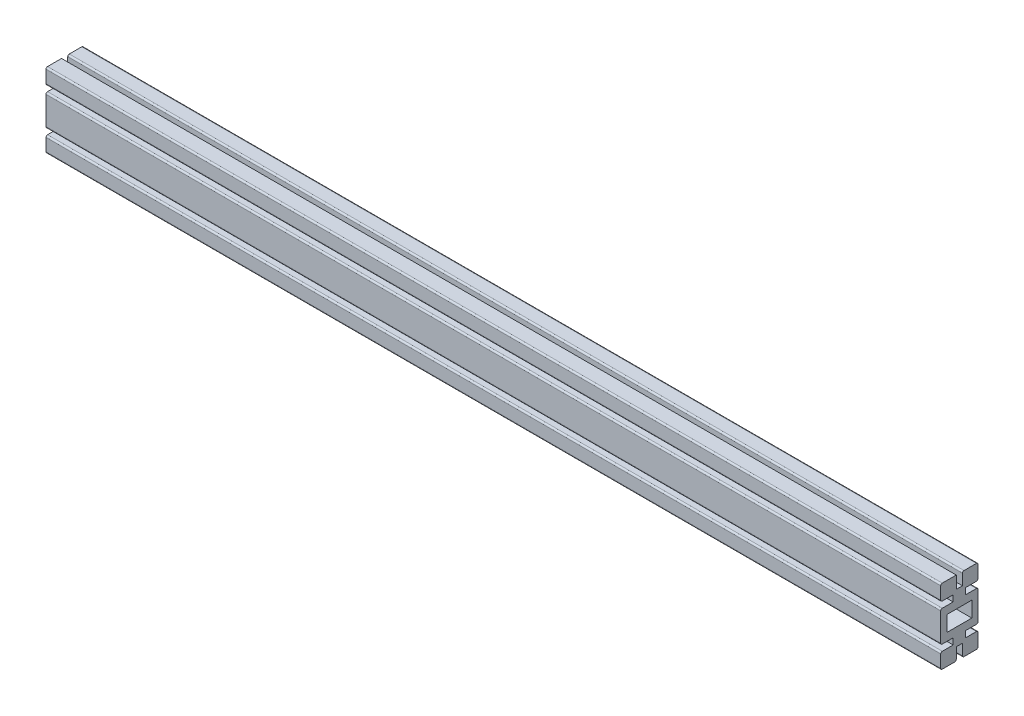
ISO-10303-21;
HEADER;
FILE_DESCRIPTION(('STEP AP214'),'2;1');
FILE_NAME('part.step','',(''),(''),'','','');
FILE_SCHEMA(('AUTOMOTIVE_DESIGN { 1 0 10303 214 1 1 1 1 }'));
ENDSEC;
DATA;
#1=APPLICATION_CONTEXT('core data for automotive mechanical design processes');
#2=APPLICATION_PROTOCOL_DEFINITION('international standard','automotive_design',2000,#1);
#3=PRODUCT_CONTEXT('',#1,'mechanical');
#4=PRODUCT('Part','Part','',(#3));
#5=PRODUCT_RELATED_PRODUCT_CATEGORY('part','',(#4));
#6=PRODUCT_DEFINITION_FORMATION('','',#4);
#7=PRODUCT_DEFINITION_CONTEXT('part definition',#1,'design');
#8=PRODUCT_DEFINITION('design','',#6,#7);
#9=PRODUCT_DEFINITION_SHAPE('','',#8);
#10=(LENGTH_UNIT() NAMED_UNIT(*) SI_UNIT(.MILLI.,.METRE.));
#11=(NAMED_UNIT(*) PLANE_ANGLE_UNIT() SI_UNIT($,.RADIAN.));
#12=(NAMED_UNIT(*) SI_UNIT($,.STERADIAN.) SOLID_ANGLE_UNIT());
#13=UNCERTAINTY_MEASURE_WITH_UNIT(LENGTH_MEASURE(1.E-05),#10,'distance_accuracy_value','');
#14=(GEOMETRIC_REPRESENTATION_CONTEXT(3) GLOBAL_UNCERTAINTY_ASSIGNED_CONTEXT((#13)) GLOBAL_UNIT_ASSIGNED_CONTEXT((#10,
#11,#12)) REPRESENTATION_CONTEXT('',''));
#15=CARTESIAN_POINT('',(0.,0.,0.));
#16=DIRECTION('',(0.,0.,1.));
#17=DIRECTION('',(1.,0.,0.));
#18=AXIS2_PLACEMENT_3D('',#15,#16,#17);
#19=CARTESIAN_POINT('',(-914.4,-38.1,19.05));
#20=DIRECTION('',(0.,-1.00000000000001,0.));
#21=DIRECTION('',(0.,0.,-0.999999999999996));
#22=AXIS2_PLACEMENT_3D('',#19,#20,#21);
#23=PLANE('',#22);
#24=DIRECTION('',(0.,0.,-0.999999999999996));
#25=VECTOR('',#24,1.);
#26=CARTESIAN_POINT('',(-914.4,-38.1,19.05));
#27=LINE('',#26,#25);
#28=CARTESIAN_POINT('',(-914.4,-38.1,17.4752));
#29=VERTEX_POINT('',#28);
#30=CARTESIAN_POINT('',(-914.4,-38.1,4.74980000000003));
#31=VERTEX_POINT('',#30);
#32=EDGE_CURVE('E524',#29,#31,#27,.T.);
#33=ORIENTED_EDGE('',*,*,#32,.T.);
#34=DIRECTION('',(1.,0.,0.));
#35=VECTOR('',#34,1.);
#36=CARTESIAN_POINT('',(0.,-38.1,4.74980000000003));
#37=LINE('',#36,#35);
#38=CARTESIAN_POINT('',(0.,-38.1,4.74980000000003));
#39=VERTEX_POINT('',#38);
#40=EDGE_CURVE('E627',#31,#39,#37,.T.);
#41=ORIENTED_EDGE('',*,*,#40,.T.);
#42=DIRECTION('',(0.,0.,-0.999999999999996));
#43=VECTOR('',#42,1.);
#44=CARTESIAN_POINT('',(0.,-38.1,19.05));
#45=LINE('',#44,#43);
#46=CARTESIAN_POINT('',(0.,-38.1,17.4752));
#47=VERTEX_POINT('',#46);
#48=EDGE_CURVE('E542',#47,#39,#45,.T.);
#49=ORIENTED_EDGE('',*,*,#48,.F.);
#50=DIRECTION('',(1.,0.,0.));
#51=VECTOR('',#50,1.);
#52=CARTESIAN_POINT('',(-914.4,-38.1,17.4752));
#53=LINE('',#52,#51);
#54=EDGE_CURVE('E625',#47,#29,#53,.F.);
#55=ORIENTED_EDGE('',*,*,#54,.T.);
#56=EDGE_LOOP('',(#33,#41,#49,#55));
#57=FACE_BOUND('',#56,.T.);
#58=ADVANCED_FACE('F46',(#57),#23,.T.);
#59=CARTESIAN_POINT('',(-914.4,38.1,19.05));
#60=DIRECTION('',(0.,1.00000000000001,0.));
#61=DIRECTION('',(0.,0.,0.999999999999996));
#62=AXIS2_PLACEMENT_3D('',#59,#60,#61);
#63=PLANE('',#62);
#64=DIRECTION('',(0.,0.,0.999999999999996));
#65=VECTOR('',#64,1.);
#66=CARTESIAN_POINT('',(-914.4,38.1,19.05));
#67=LINE('',#66,#65);
#68=CARTESIAN_POINT('',(-914.4,38.1,3.17500000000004));
#69=VERTEX_POINT('',#68);
#70=CARTESIAN_POINT('',(-914.4,38.1,17.4752));
#71=VERTEX_POINT('',#70);
#72=EDGE_CURVE('E528',#69,#71,#67,.T.);
#73=ORIENTED_EDGE('',*,*,#72,.T.);
#74=DIRECTION('',(1.,0.,0.));
#75=VECTOR('',#74,1.);
#76=CARTESIAN_POINT('',(-914.4,38.1,17.4752));
#77=LINE('',#76,#75);
#78=CARTESIAN_POINT('',(0.,38.1,17.4752));
#79=VERTEX_POINT('',#78);
#80=EDGE_CURVE('E661',#71,#79,#77,.T.);
#81=ORIENTED_EDGE('',*,*,#80,.T.);
#82=DIRECTION('',(0.,0.,0.999999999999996));
#83=VECTOR('',#82,1.);
#84=CARTESIAN_POINT('',(0.,38.1,19.05));
#85=LINE('',#84,#83);
#86=CARTESIAN_POINT('',(0.,38.1,3.17500000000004));
#87=VERTEX_POINT('',#86);
#88=EDGE_CURVE('E551',#87,#79,#85,.T.);
#89=ORIENTED_EDGE('',*,*,#88,.F.);
#90=DIRECTION('',(1.,0.,0.));
#91=VECTOR('',#90,1.);
#92=CARTESIAN_POINT('',(-914.4,38.1,3.17500000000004));
#93=LINE('',#92,#91);
#94=EDGE_CURVE('E426',#69,#87,#93,.T.);
#95=ORIENTED_EDGE('',*,*,#94,.F.);
#96=EDGE_LOOP('',(#73,#81,#89,#95));
#97=FACE_BOUND('',#96,.T.);
#98=ADVANCED_FACE('F723',(#97),#63,.T.);
#99=CARTESIAN_POINT('',(-914.4,-38.1,-19.05));
#100=DIRECTION('',(0.,0.,-0.999999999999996));
#101=DIRECTION('',(-1.,0.,0.));
#102=AXIS2_PLACEMENT_3D('',#99,#100,#101);
#103=PLANE('',#102);
#104=DIRECTION('',(0.,1.00000000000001,0.));
#105=VECTOR('',#104,1.);
#106=CARTESIAN_POINT('',(0.,-38.1,-19.05));
#107=LINE('',#106,#105);
#108=CARTESIAN_POINT('',(0.,-14.3002000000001,-19.05));
#109=VERTEX_POINT('',#108);
#110=CARTESIAN_POINT('',(0.,14.3002000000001,-19.05));
#111=VERTEX_POINT('',#110);
#112=EDGE_CURVE('E546',#109,#111,#107,.T.);
#113=ORIENTED_EDGE('',*,*,#112,.F.);
#114=DIRECTION('',(1.,0.,0.));
#115=VECTOR('',#114,1.);
#116=CARTESIAN_POINT('',(-914.4,-14.3002000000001,-19.05));
#117=LINE('',#116,#115);
#118=CARTESIAN_POINT('',(-914.4,-14.3002000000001,-19.05));
#119=VERTEX_POINT('',#118);
#120=EDGE_CURVE('E623',#109,#119,#117,.F.);
#121=ORIENTED_EDGE('',*,*,#120,.T.);
#122=DIRECTION('',(0.,1.00000000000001,0.));
#123=VECTOR('',#122,1.);
#124=CARTESIAN_POINT('',(-914.4,-38.1,-19.05));
#125=LINE('',#124,#123);
#126=CARTESIAN_POINT('',(-914.4,14.3002000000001,-19.05));
#127=VERTEX_POINT('',#126);
#128=EDGE_CURVE('E529',#119,#127,#125,.T.);
#129=ORIENTED_EDGE('',*,*,#128,.T.);
#130=DIRECTION('',(1.,0.,0.));
#131=VECTOR('',#130,1.);
#132=CARTESIAN_POINT('',(0.,14.3002000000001,-19.05));
#133=LINE('',#132,#131);
#134=EDGE_CURVE('E620',#127,#111,#133,.T.);
#135=ORIENTED_EDGE('',*,*,#134,.T.);
#136=EDGE_LOOP('',(#113,#121,#129,#135));
#137=FACE_BOUND('',#136,.T.);
#138=ADVANCED_FACE('F810',(#137),#103,.T.);
#139=CARTESIAN_POINT('',(0.,-36.5252,-19.05));
#140=VERTEX_POINT('',#139);
#141=CARTESIAN_POINT('',(0.,-23.7997999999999,-19.05));
#142=VERTEX_POINT('',#141);
#143=EDGE_CURVE('E547',#140,#142,#107,.T.);
#144=ORIENTED_EDGE('',*,*,#143,.F.);
#145=DIRECTION('',(1.,0.,0.));
#146=VECTOR('',#145,1.);
#147=CARTESIAN_POINT('',(-914.4,-36.5252,-19.05));
#148=LINE('',#147,#146);
#149=CARTESIAN_POINT('',(-914.4,-36.5252,-19.05));
#150=VERTEX_POINT('',#149);
#151=EDGE_CURVE('E643',#140,#150,#148,.F.);
#152=ORIENTED_EDGE('',*,*,#151,.T.);
#153=CARTESIAN_POINT('',(-914.4,-23.7997999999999,-19.05));
#154=VERTEX_POINT('',#153);
#155=EDGE_CURVE('E525',#150,#154,#125,.T.);
#156=ORIENTED_EDGE('',*,*,#155,.T.);
#157=DIRECTION('',(1.,0.,0.));
#158=VECTOR('',#157,1.);
#159=CARTESIAN_POINT('',(0.,-23.7997999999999,-19.05));
#160=LINE('',#159,#158);
#161=EDGE_CURVE('E640',#154,#142,#160,.T.);
#162=ORIENTED_EDGE('',*,*,#161,.T.);
#163=EDGE_LOOP('',(#144,#152,#156,#162));
#164=FACE_BOUND('',#163,.T.);
#165=ADVANCED_FACE('F793',(#164),#103,.T.);
#166=CARTESIAN_POINT('',(-914.4,-38.1,19.05));
#167=DIRECTION('',(0.,0.,0.999999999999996));
#168=DIRECTION('',(1.,0.,0.));
#169=AXIS2_PLACEMENT_3D('',#166,#167,#168);
#170=PLANE('',#169);
#171=DIRECTION('',(0.,-1.00000000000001,0.));
#172=VECTOR('',#171,1.);
#173=CARTESIAN_POINT('',(-914.4,-38.1,19.05));
#174=LINE('',#173,#172);
#175=CARTESIAN_POINT('',(-914.4,14.3002000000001,19.05));
#176=VERTEX_POINT('',#175);
#177=CARTESIAN_POINT('',(-914.4,-14.3002000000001,19.05));
#178=VERTEX_POINT('',#177);
#179=EDGE_CURVE('E521',#176,#178,#174,.T.);
#180=ORIENTED_EDGE('',*,*,#179,.T.);
#181=DIRECTION('',(1.,0.,0.));
#182=VECTOR('',#181,1.);
#183=CARTESIAN_POINT('',(0.,-14.3002000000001,19.05));
#184=LINE('',#183,#182);
#185=CARTESIAN_POINT('',(0.,-14.3002000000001,19.05));
#186=VERTEX_POINT('',#185);
#187=EDGE_CURVE('E674',#178,#186,#184,.T.);
#188=ORIENTED_EDGE('',*,*,#187,.T.);
#189=DIRECTION('',(0.,-1.00000000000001,0.));
#190=VECTOR('',#189,1.);
#191=CARTESIAN_POINT('',(0.,-38.1,19.05));
#192=LINE('',#191,#190);
#193=CARTESIAN_POINT('',(0.,14.3002000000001,19.05));
#194=VERTEX_POINT('',#193);
#195=EDGE_CURVE('E537',#194,#186,#192,.T.);
#196=ORIENTED_EDGE('',*,*,#195,.F.);
#197=DIRECTION('',(1.,0.,0.));
#198=VECTOR('',#197,1.);
#199=CARTESIAN_POINT('',(-914.4,14.3002000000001,19.05));
#200=LINE('',#199,#198);
#201=EDGE_CURVE('E672',#194,#176,#200,.F.);
#202=ORIENTED_EDGE('',*,*,#201,.T.);
#203=EDGE_LOOP('',(#180,#188,#196,#202));
#204=FACE_BOUND('',#203,.T.);
#205=ADVANCED_FACE('F705',(#204),#170,.T.);
#206=CARTESIAN_POINT('',(0.,36.5252,19.05));
#207=VERTEX_POINT('',#206);
#208=CARTESIAN_POINT('',(0.,23.7997999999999,19.05));
#209=VERTEX_POINT('',#208);
#210=EDGE_CURVE('E538',#207,#209,#192,.T.);
#211=ORIENTED_EDGE('',*,*,#210,.F.);
#212=DIRECTION('',(1.,0.,0.));
#213=VECTOR('',#212,1.);
#214=CARTESIAN_POINT('',(-914.4,36.5252,19.05));
#215=LINE('',#214,#213);
#216=CARTESIAN_POINT('',(-914.4,36.5252,19.05));
#217=VERTEX_POINT('',#216);
#218=EDGE_CURVE('E667',#207,#217,#215,.F.);
#219=ORIENTED_EDGE('',*,*,#218,.T.);
#220=CARTESIAN_POINT('',(-914.4,23.7997999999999,19.05));
#221=VERTEX_POINT('',#220);
#222=EDGE_CURVE('E517',#217,#221,#174,.T.);
#223=ORIENTED_EDGE('',*,*,#222,.T.);
#224=DIRECTION('',(1.,0.,0.));
#225=VECTOR('',#224,1.);
#226=CARTESIAN_POINT('',(0.,23.7997999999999,19.05));
#227=LINE('',#226,#225);
#228=EDGE_CURVE('E664',#221,#209,#227,.T.);
#229=ORIENTED_EDGE('',*,*,#228,.T.);
#230=EDGE_LOOP('',(#211,#219,#223,#229));
#231=FACE_BOUND('',#230,.T.);
#232=ADVANCED_FACE('F712',(#231),#170,.T.);
#233=CARTESIAN_POINT('',(-914.4,-23.7997999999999,19.05));
#234=VERTEX_POINT('',#233);
#235=CARTESIAN_POINT('',(-914.4,-36.5252,19.05));
#236=VERTEX_POINT('',#235);
#237=EDGE_CURVE('E522',#234,#236,#174,.T.);
#238=ORIENTED_EDGE('',*,*,#237,.T.);
#239=DIRECTION('',(1.,0.,0.));
#240=VECTOR('',#239,1.);
#241=CARTESIAN_POINT('',(-914.4,-36.5252,19.05));
#242=LINE('',#241,#240);
#243=CARTESIAN_POINT('',(0.,-36.5252,19.05));
#244=VERTEX_POINT('',#243);
#245=EDGE_CURVE('E652',#236,#244,#242,.T.);
#246=ORIENTED_EDGE('',*,*,#245,.T.);
#247=CARTESIAN_POINT('',(0.,-23.7997999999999,19.05));
#248=VERTEX_POINT('',#247);
#249=EDGE_CURVE('E514',#248,#244,#192,.T.);
#250=ORIENTED_EDGE('',*,*,#249,.F.);
#251=DIRECTION('',(1.,0.,0.));
#252=VECTOR('',#251,1.);
#253=CARTESIAN_POINT('',(-914.4,-23.7997999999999,19.05));
#254=LINE('',#253,#252);
#255=EDGE_CURVE('E650',#248,#234,#254,.F.);
#256=ORIENTED_EDGE('',*,*,#255,.T.);
#257=EDGE_LOOP('',(#238,#246,#250,#256));
#258=FACE_BOUND('',#257,.T.);
#259=ADVANCED_FACE('F823',(#258),#170,.T.);
#260=CARTESIAN_POINT('',(0.,38.1,-17.4752));
#261=VERTEX_POINT('',#260);
#262=CARTESIAN_POINT('',(0.,38.1,-4.74980000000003));
#263=VERTEX_POINT('',#262);
#264=EDGE_CURVE('E548',#261,#263,#85,.T.);
#265=ORIENTED_EDGE('',*,*,#264,.F.);
#266=DIRECTION('',(1.,0.,0.));
#267=VECTOR('',#266,1.);
#268=CARTESIAN_POINT('',(-914.4,38.1,-17.4752));
#269=LINE('',#268,#267);
#270=CARTESIAN_POINT('',(-914.4,38.1,-17.4752));
#271=VERTEX_POINT('',#270);
#272=EDGE_CURVE('E648',#261,#271,#269,.F.);
#273=ORIENTED_EDGE('',*,*,#272,.T.);
#274=CARTESIAN_POINT('',(-914.4,38.1,-4.74980000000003));
#275=VERTEX_POINT('',#274);
#276=EDGE_CURVE('E531',#271,#275,#67,.T.);
#277=ORIENTED_EDGE('',*,*,#276,.T.);
#278=DIRECTION('',(1.,0.,0.));
#279=VECTOR('',#278,1.);
#280=CARTESIAN_POINT('',(0.,38.1,-4.74980000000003));
#281=LINE('',#280,#279);
#282=EDGE_CURVE('E645',#275,#263,#281,.T.);
#283=ORIENTED_EDGE('',*,*,#282,.T.);
#284=EDGE_LOOP('',(#265,#273,#277,#283));
#285=FACE_BOUND('',#284,.T.);
#286=ADVANCED_FACE('F743',(#285),#63,.T.);
#287=CARTESIAN_POINT('',(0.,23.7997999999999,-19.05));
#288=VERTEX_POINT('',#287);
#289=CARTESIAN_POINT('',(0.,36.5252,-19.05));
#290=VERTEX_POINT('',#289);
#291=EDGE_CURVE('E543',#288,#290,#107,.T.);
#292=ORIENTED_EDGE('',*,*,#291,.F.);
#293=DIRECTION('',(1.,0.,0.));
#294=VECTOR('',#293,1.);
#295=CARTESIAN_POINT('',(-914.4,23.7997999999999,-19.05));
#296=LINE('',#295,#294);
#297=CARTESIAN_POINT('',(-914.4,23.7997999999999,-19.05));
#298=VERTEX_POINT('',#297);
#299=EDGE_CURVE('E587',#288,#298,#296,.F.);
#300=ORIENTED_EDGE('',*,*,#299,.T.);
#301=CARTESIAN_POINT('',(-914.4,36.5252,-19.05));
#302=VERTEX_POINT('',#301);
#303=EDGE_CURVE('E530',#298,#302,#125,.T.);
#304=ORIENTED_EDGE('',*,*,#303,.T.);
#305=DIRECTION('',(1.,0.,0.));
#306=VECTOR('',#305,1.);
#307=CARTESIAN_POINT('',(-914.4,36.5252,-19.05));
#308=LINE('',#307,#306);
#309=EDGE_CURVE('E584',#302,#290,#308,.T.);
#310=ORIENTED_EDGE('',*,*,#309,.T.);
#311=EDGE_LOOP('',(#292,#300,#304,#310));
#312=FACE_BOUND('',#311,.T.);
#313=ADVANCED_FACE('F752',(#312),#103,.T.);
#314=CARTESIAN_POINT('',(0.,-38.1,-4.74980000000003));
#315=VERTEX_POINT('',#314);
#316=CARTESIAN_POINT('',(0.,-38.1,-17.4752));
#317=VERTEX_POINT('',#316);
#318=EDGE_CURVE('E539',#315,#317,#45,.T.);
#319=ORIENTED_EDGE('',*,*,#318,.F.);
#320=DIRECTION('',(1.,0.,0.));
#321=VECTOR('',#320,1.);
#322=CARTESIAN_POINT('',(-914.4,-38.1,-4.74980000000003));
#323=LINE('',#322,#321);
#324=CARTESIAN_POINT('',(-914.4,-38.1,-4.74980000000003));
#325=VERTEX_POINT('',#324);
#326=EDGE_CURVE('E638',#315,#325,#323,.F.);
#327=ORIENTED_EDGE('',*,*,#326,.T.);
#328=CARTESIAN_POINT('',(-914.4,-38.1,-17.4752));
#329=VERTEX_POINT('',#328);
#330=EDGE_CURVE('E520',#325,#329,#27,.T.);
#331=ORIENTED_EDGE('',*,*,#330,.T.);
#332=DIRECTION('',(1.,0.,0.));
#333=VECTOR('',#332,1.);
#334=CARTESIAN_POINT('',(-914.4,-38.1,-17.4752));
#335=LINE('',#334,#333);
#336=EDGE_CURVE('E635',#329,#317,#335,.T.);
#337=ORIENTED_EDGE('',*,*,#336,.T.);
#338=EDGE_LOOP('',(#319,#327,#331,#337));
#339=FACE_BOUND('',#338,.T.);
#340=ADVANCED_FACE('F786',(#339),#23,.T.);
#341=CARTESIAN_POINT('',(-914.4,38.1,19.05));
#342=DIRECTION('',(-1.,0.,0.));
#343=DIRECTION('',(0.,0.,0.999999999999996));
#344=AXIS2_PLACEMENT_3D('',#341,#342,#343);
#345=PLANE('',#344);
#346=DIRECTION('',(0.,-1.00000000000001,0.));
#347=VECTOR('',#346,1.);
#348=CARTESIAN_POINT('',(-914.4,-7.92480000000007,12.7));
#349=LINE('',#348,#347);
#350=CARTESIAN_POINT('',(-914.4,7.95020000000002,12.7));
#351=VERTEX_POINT('',#350);
#352=CARTESIAN_POINT('',(-914.4,-7.92480000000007,12.7));
#353=VERTEX_POINT('',#352);
#354=EDGE_CURVE('E349',#351,#353,#349,.T.);
#355=ORIENTED_EDGE('',*,*,#354,.T.);
#356=DIRECTION('',(0.,0.,-0.999999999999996));
#357=VECTOR('',#356,1.);
#358=CARTESIAN_POINT('',(-914.4,-7.92480000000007,12.7));
#359=LINE('',#358,#357);
#360=CARTESIAN_POINT('',(-914.4,-7.92480000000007,-12.7));
#361=VERTEX_POINT('',#360);
#362=EDGE_CURVE('E361',#353,#361,#359,.T.);
#363=ORIENTED_EDGE('',*,*,#362,.T.);
#364=DIRECTION('',(0.,1.00000000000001,0.));
#365=VECTOR('',#364,1.);
#366=CARTESIAN_POINT('',(-914.4,-7.92480000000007,-12.7));
#367=LINE('',#366,#365);
#368=CARTESIAN_POINT('',(-914.4,7.95020000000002,-12.7));
#369=VERTEX_POINT('',#368);
#370=EDGE_CURVE('E365',#361,#369,#367,.T.);
#371=ORIENTED_EDGE('',*,*,#370,.T.);
#372=DIRECTION('',(0.,0.,0.999999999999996));
#373=VECTOR('',#372,1.);
#374=CARTESIAN_POINT('',(-914.4,7.95020000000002,12.7));
#375=LINE('',#374,#373);
#376=EDGE_CURVE('E357',#369,#351,#375,.T.);
#377=ORIENTED_EDGE('',*,*,#376,.T.);
#378=EDGE_LOOP('',(#355,#363,#371,#377));
#379=FACE_BOUND('',#378,.T.);
#380=ORIENTED_EDGE('',*,*,#303,.F.);
#381=CARTESIAN_POINT('',(-914.4,23.7997999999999,-17.4752));
#382=DIRECTION('',(-1.,0.,0.));
#383=DIRECTION('',(0.,0.,0.999999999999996));
#384=AXIS2_PLACEMENT_3D('',#381,#382,#383);
#385=CIRCLE('',#384,1.5748);
#386=CARTESIAN_POINT('',(-914.4,22.2249999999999,-17.4752));
#387=VERTEX_POINT('',#386);
#388=EDGE_CURVE('E615',#298,#387,#385,.T.);
#389=ORIENTED_EDGE('',*,*,#388,.T.);
#390=DIRECTION('',(0.,0.,0.999999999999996));
#391=VECTOR('',#390,1.);
#392=CARTESIAN_POINT('',(-914.4,22.2249999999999,-19.05));
#393=LINE('',#392,#391);
#394=CARTESIAN_POINT('',(-914.4,22.2249999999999,-6.34999999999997));
#395=VERTEX_POINT('',#394);
#396=EDGE_CURVE('E433',#387,#395,#393,.T.);
#397=ORIENTED_EDGE('',*,*,#396,.T.);
#398=DIRECTION('',(0.,-1.00000000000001,0.));
#399=VECTOR('',#398,1.);
#400=CARTESIAN_POINT('',(-914.4,15.8750000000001,-6.34999999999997));
#401=LINE('',#400,#399);
#402=CARTESIAN_POINT('',(-914.4,15.8750000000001,-6.34999999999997));
#403=VERTEX_POINT('',#402);
#404=EDGE_CURVE('E435',#395,#403,#401,.T.);
#405=ORIENTED_EDGE('',*,*,#404,.T.);
#406=DIRECTION('',(0.,0.,-0.999999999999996));
#407=VECTOR('',#406,1.);
#408=CARTESIAN_POINT('',(-914.4,15.8750000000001,-19.05));
#409=LINE('',#408,#407);
#410=CARTESIAN_POINT('',(-914.4,15.8750000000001,-17.4752));
#411=VERTEX_POINT('',#410);
#412=EDGE_CURVE('E439',#403,#411,#409,.T.);
#413=ORIENTED_EDGE('',*,*,#412,.T.);
#414=CARTESIAN_POINT('',(-914.4,14.3002000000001,-17.4752));
#415=DIRECTION('',(-1.,0.,0.));
#416=DIRECTION('',(0.,0.,0.999999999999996));
#417=AXIS2_PLACEMENT_3D('',#414,#415,#416);
#418=CIRCLE('',#417,1.5748);
#419=EDGE_CURVE('E601',#411,#127,#418,.T.);
#420=ORIENTED_EDGE('',*,*,#419,.T.);
#421=ORIENTED_EDGE('',*,*,#128,.F.);
#422=CARTESIAN_POINT('',(-914.4,-14.3002000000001,-17.4752));
#423=DIRECTION('',(-1.,0.,0.));
#424=DIRECTION('',(0.,0.,0.999999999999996));
#425=AXIS2_PLACEMENT_3D('',#422,#423,#424);
#426=CIRCLE('',#425,1.5748);
#427=CARTESIAN_POINT('',(-914.4,-15.8750000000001,-17.4752));
#428=VERTEX_POINT('',#427);
#429=EDGE_CURVE('E613',#119,#428,#426,.T.);
#430=ORIENTED_EDGE('',*,*,#429,.T.);
#431=DIRECTION('',(0.,0.,0.999999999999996));
#432=VECTOR('',#431,1.);
#433=CARTESIAN_POINT('',(-914.4,-15.8750000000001,-19.05));
#434=LINE('',#433,#432);
#435=CARTESIAN_POINT('',(-914.4,-15.8750000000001,-6.34999999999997));
#436=VERTEX_POINT('',#435);
#437=EDGE_CURVE('E454',#428,#436,#434,.T.);
#438=ORIENTED_EDGE('',*,*,#437,.T.);
#439=DIRECTION('',(0.,-1.00000000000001,0.));
#440=VECTOR('',#439,1.);
#441=CARTESIAN_POINT('',(-914.4,-22.2249999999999,-6.34999999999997));
#442=LINE('',#441,#440);
#443=CARTESIAN_POINT('',(-914.4,-22.2249999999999,-6.34999999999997));
#444=VERTEX_POINT('',#443);
#445=EDGE_CURVE('E456',#436,#444,#442,.T.);
#446=ORIENTED_EDGE('',*,*,#445,.T.);
#447=DIRECTION('',(0.,0.,-0.999999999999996));
#448=VECTOR('',#447,1.);
#449=CARTESIAN_POINT('',(-914.4,-22.2249999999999,-19.05));
#450=LINE('',#449,#448);
#451=CARTESIAN_POINT('',(-914.4,-22.2249999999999,-17.4752));
#452=VERTEX_POINT('',#451);
#453=EDGE_CURVE('E460',#444,#452,#450,.T.);
#454=ORIENTED_EDGE('',*,*,#453,.T.);
#455=CARTESIAN_POINT('',(-914.4,-23.7997999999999,-17.4752));
#456=DIRECTION('',(-1.,0.,0.));
#457=DIRECTION('',(0.,0.,0.999999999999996));
#458=AXIS2_PLACEMENT_3D('',#455,#456,#457);
#459=CIRCLE('',#458,1.5748);
#460=EDGE_CURVE('E603',#452,#154,#459,.T.);
#461=ORIENTED_EDGE('',*,*,#460,.T.);
#462=ORIENTED_EDGE('',*,*,#155,.F.);
#463=CARTESIAN_POINT('',(-914.4,-36.5252,-17.4752));
#464=DIRECTION('',(-1.,0.,0.));
#465=DIRECTION('',(0.,0.,0.999999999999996));
#466=AXIS2_PLACEMENT_3D('',#463,#464,#465);
#467=CIRCLE('',#466,1.5748);
#468=EDGE_CURVE('E67',#150,#329,#467,.T.);
#469=ORIENTED_EDGE('',*,*,#468,.T.);
#470=ORIENTED_EDGE('',*,*,#330,.F.);
#471=CARTESIAN_POINT('',(-914.4,-36.5252,-4.74980000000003));
#472=DIRECTION('',(-1.,0.,0.));
#473=DIRECTION('',(0.,0.,0.999999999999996));
#474=AXIS2_PLACEMENT_3D('',#471,#472,#473);
#475=CIRCLE('',#474,1.5748);
#476=CARTESIAN_POINT('',(-914.4,-36.5252,-3.17500000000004));
#477=VERTEX_POINT('',#476);
#478=EDGE_CURVE('E61',#325,#477,#475,.T.);
#479=ORIENTED_EDGE('',*,*,#478,.T.);
#480=DIRECTION('',(0.,1.00000000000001,0.));
#481=VECTOR('',#480,1.);
#482=CARTESIAN_POINT('',(-914.4,-38.1,-3.17500000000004));
#483=LINE('',#482,#481);
#484=CARTESIAN_POINT('',(-914.4,-25.4000000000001,-3.17500000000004));
#485=VERTEX_POINT('',#484);
#486=EDGE_CURVE('E391',#477,#485,#483,.T.);
#487=ORIENTED_EDGE('',*,*,#486,.T.);
#488=DIRECTION('',(0.,0.,0.999999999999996));
#489=VECTOR('',#488,1.);
#490=CARTESIAN_POINT('',(-914.4,-25.4000000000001,3.17500000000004));
#491=LINE('',#490,#489);
#492=CARTESIAN_POINT('',(-914.4,-25.4000000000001,3.17500000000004));
#493=VERTEX_POINT('',#492);
#494=EDGE_CURVE('E394',#485,#493,#491,.T.);
#495=ORIENTED_EDGE('',*,*,#494,.T.);
#496=DIRECTION('',(0.,-1.00000000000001,0.));
#497=VECTOR('',#496,1.);
#498=CARTESIAN_POINT('',(-914.4,-38.1,3.17500000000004));
#499=LINE('',#498,#497);
#500=CARTESIAN_POINT('',(-914.4,-36.5252,3.17500000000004));
#501=VERTEX_POINT('',#500);
#502=EDGE_CURVE('E388',#493,#501,#499,.T.);
#503=ORIENTED_EDGE('',*,*,#502,.T.);
#504=CARTESIAN_POINT('',(-914.4,-36.5252,4.74980000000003));
#505=DIRECTION('',(-1.,0.,0.));
#506=DIRECTION('',(0.,0.,0.999999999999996));
#507=AXIS2_PLACEMENT_3D('',#504,#505,#506);
#508=CIRCLE('',#507,1.5748);
#509=EDGE_CURVE('E611',#501,#31,#508,.T.);
#510=ORIENTED_EDGE('',*,*,#509,.T.);
#511=ORIENTED_EDGE('',*,*,#32,.F.);
#512=CARTESIAN_POINT('',(-914.4,-36.5252,17.4752));
#513=DIRECTION('',(-1.,0.,0.));
#514=DIRECTION('',(0.,0.,0.999999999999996));
#515=AXIS2_PLACEMENT_3D('',#512,#513,#514);
#516=CIRCLE('',#515,1.5748);
#517=EDGE_CURVE('E605',#29,#236,#516,.T.);
#518=ORIENTED_EDGE('',*,*,#517,.T.);
#519=ORIENTED_EDGE('',*,*,#237,.F.);
#520=CARTESIAN_POINT('',(-914.4,-23.7997999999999,17.4752));
#521=DIRECTION('',(-1.,0.,0.));
#522=DIRECTION('',(0.,0.,0.999999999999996));
#523=AXIS2_PLACEMENT_3D('',#520,#521,#522);
#524=CIRCLE('',#523,1.5748);
#525=CARTESIAN_POINT('',(-914.4,-22.2249999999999,17.4752));
#526=VERTEX_POINT('',#525);
#527=EDGE_CURVE('E595',#234,#526,#524,.T.);
#528=ORIENTED_EDGE('',*,*,#527,.T.);
#529=DIRECTION('',(0.,0.,-0.999999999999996));
#530=VECTOR('',#529,1.);
#531=CARTESIAN_POINT('',(-914.4,-22.2249999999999,19.05));
#532=LINE('',#531,#530);
#533=CARTESIAN_POINT('',(-914.4,-22.2249999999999,6.34999999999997));
#534=VERTEX_POINT('',#533);
#535=EDGE_CURVE('E475',#526,#534,#532,.T.);
#536=ORIENTED_EDGE('',*,*,#535,.T.);
#537=DIRECTION('',(0.,1.00000000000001,0.));
#538=VECTOR('',#537,1.);
#539=CARTESIAN_POINT('',(-914.4,-22.2249999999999,6.34999999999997));
#540=LINE('',#539,#538);
#541=CARTESIAN_POINT('',(-914.4,-15.8750000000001,6.34999999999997));
#542=VERTEX_POINT('',#541);
#543=EDGE_CURVE('E477',#534,#542,#540,.T.);
#544=ORIENTED_EDGE('',*,*,#543,.T.);
#545=DIRECTION('',(0.,0.,0.999999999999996));
#546=VECTOR('',#545,1.);
#547=CARTESIAN_POINT('',(-914.4,-15.8750000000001,19.05));
#548=LINE('',#547,#546);
#549=CARTESIAN_POINT('',(-914.4,-15.8750000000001,17.4752));
#550=VERTEX_POINT('',#549);
#551=EDGE_CURVE('E481',#542,#550,#548,.T.);
#552=ORIENTED_EDGE('',*,*,#551,.T.);
#553=CARTESIAN_POINT('',(-914.4,-14.3002000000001,17.4752));
#554=DIRECTION('',(-1.,0.,0.));
#555=DIRECTION('',(0.,0.,0.999999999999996));
#556=AXIS2_PLACEMENT_3D('',#553,#554,#555);
#557=CIRCLE('',#556,1.5748);
#558=EDGE_CURVE('E593',#550,#178,#557,.T.);
#559=ORIENTED_EDGE('',*,*,#558,.T.);
#560=ORIENTED_EDGE('',*,*,#179,.F.);
#561=CARTESIAN_POINT('',(-914.4,14.3002000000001,17.4752));
#562=DIRECTION('',(-1.,0.,0.));
#563=DIRECTION('',(0.,0.,0.999999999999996));
#564=AXIS2_PLACEMENT_3D('',#561,#562,#563);
#565=CIRCLE('',#564,1.5748);
#566=CARTESIAN_POINT('',(-914.4,15.8750000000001,17.4752));
#567=VERTEX_POINT('',#566);
#568=EDGE_CURVE('E591',#176,#567,#565,.T.);
#569=ORIENTED_EDGE('',*,*,#568,.T.);
#570=DIRECTION('',(0.,0.,-0.999999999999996));
#571=VECTOR('',#570,1.);
#572=CARTESIAN_POINT('',(-914.4,15.8750000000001,19.05));
#573=LINE('',#572,#571);
#574=CARTESIAN_POINT('',(-914.4,15.8750000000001,6.34999999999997));
#575=VERTEX_POINT('',#574);
#576=EDGE_CURVE('E496',#567,#575,#573,.T.);
#577=ORIENTED_EDGE('',*,*,#576,.T.);
#578=DIRECTION('',(0.,1.00000000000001,0.));
#579=VECTOR('',#578,1.);
#580=CARTESIAN_POINT('',(-914.4,15.8750000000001,6.34999999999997));
#581=LINE('',#580,#579);
#582=CARTESIAN_POINT('',(-914.4,22.2249999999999,6.34999999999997));
#583=VERTEX_POINT('',#582);
#584=EDGE_CURVE('E498',#575,#583,#581,.T.);
#585=ORIENTED_EDGE('',*,*,#584,.T.);
#586=DIRECTION('',(0.,0.,0.999999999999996));
#587=VECTOR('',#586,1.);
#588=CARTESIAN_POINT('',(-914.4,22.2249999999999,19.05));
#589=LINE('',#588,#587);
#590=CARTESIAN_POINT('',(-914.4,22.2249999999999,17.4752));
#591=VERTEX_POINT('',#590);
#592=EDGE_CURVE('E502',#583,#591,#589,.T.);
#593=ORIENTED_EDGE('',*,*,#592,.T.);
#594=CARTESIAN_POINT('',(-914.4,23.7997999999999,17.4752));
#595=DIRECTION('',(-1.,0.,0.));
#596=DIRECTION('',(0.,0.,0.999999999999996));
#597=AXIS2_PLACEMENT_3D('',#594,#595,#596);
#598=CIRCLE('',#597,1.5748);
#599=EDGE_CURVE('E589',#591,#221,#598,.T.);
#600=ORIENTED_EDGE('',*,*,#599,.T.);
#601=ORIENTED_EDGE('',*,*,#222,.F.);
#602=CARTESIAN_POINT('',(-914.4,36.5252,17.4752));
#603=DIRECTION('',(-1.,0.,0.));
#604=DIRECTION('',(0.,0.,0.999999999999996));
#605=AXIS2_PLACEMENT_3D('',#602,#603,#604);
#606=CIRCLE('',#605,1.5748);
#607=EDGE_CURVE('E597',#217,#71,#606,.T.);
#608=ORIENTED_EDGE('',*,*,#607,.T.);
#609=ORIENTED_EDGE('',*,*,#72,.F.);
#610=DIRECTION('',(0.,-1.00000000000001,0.));
#611=VECTOR('',#610,1.);
#612=CARTESIAN_POINT('',(-914.4,38.1,3.17500000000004));
#613=LINE('',#612,#611);
#614=CARTESIAN_POINT('',(-914.4,25.4000000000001,3.17500000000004));
#615=VERTEX_POINT('',#614);
#616=EDGE_CURVE('E409',#69,#615,#613,.T.);
#617=ORIENTED_EDGE('',*,*,#616,.T.);
#618=DIRECTION('',(0.,0.,-0.999999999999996));
#619=VECTOR('',#618,1.);
#620=CARTESIAN_POINT('',(-914.4,25.4000000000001,3.17500000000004));
#621=LINE('',#620,#619);
#622=CARTESIAN_POINT('',(-914.4,25.4000000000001,-3.17500000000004));
#623=VERTEX_POINT('',#622);
#624=EDGE_CURVE('E412',#615,#623,#621,.T.);
#625=ORIENTED_EDGE('',*,*,#624,.T.);
#626=DIRECTION('',(0.,1.00000000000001,0.));
#627=VECTOR('',#626,1.);
#628=CARTESIAN_POINT('',(-914.4,38.1,-3.17500000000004));
#629=LINE('',#628,#627);
#630=CARTESIAN_POINT('',(-914.4,36.5252,-3.17500000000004));
#631=VERTEX_POINT('',#630);
#632=EDGE_CURVE('E416',#623,#631,#629,.T.);
#633=ORIENTED_EDGE('',*,*,#632,.T.);
#634=CARTESIAN_POINT('',(-914.4,36.5252,-4.74980000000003));
#635=DIRECTION('',(-1.,0.,0.));
#636=DIRECTION('',(0.,0.,0.999999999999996));
#637=AXIS2_PLACEMENT_3D('',#634,#635,#636);
#638=CIRCLE('',#637,1.5748);
#639=EDGE_CURVE('E599',#631,#275,#638,.T.);
#640=ORIENTED_EDGE('',*,*,#639,.T.);
#641=ORIENTED_EDGE('',*,*,#276,.F.);
#642=CARTESIAN_POINT('',(-914.4,36.5252,-17.4752));
#643=DIRECTION('',(-1.,0.,0.));
#644=DIRECTION('',(0.,0.,0.999999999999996));
#645=AXIS2_PLACEMENT_3D('',#642,#643,#644);
#646=CIRCLE('',#645,1.5748);
#647=EDGE_CURVE('E607',#271,#302,#646,.T.);
#648=ORIENTED_EDGE('',*,*,#647,.T.);
#649=EDGE_LOOP('',(#380,#389,#397,#405,#413,#420,#421,#430,#438,#446,#454,#461,#462,#469,#470,
#479,#487,#495,#503,#510,#511,#518,#519,#528,#536,#544,#552,#559,#560,#569,#577,#585,#593,#600,
#601,#608,#609,#617,#625,#633,#640,#641,#648));
#650=FACE_BOUND('',#649,.T.);
#651=ADVANCED_FACE('F367',(#379,#650),#345,.T.);
#652=CARTESIAN_POINT('',(0.,38.1,19.05));
#653=DIRECTION('',(-1.,0.,0.));
#654=DIRECTION('',(0.,0.,0.999999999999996));
#655=AXIS2_PLACEMENT_3D('',#652,#653,#654);
#656=PLANE('',#655);
#657=DIRECTION('',(0.,0.,-0.999999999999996));
#658=VECTOR('',#657,1.);
#659=CARTESIAN_POINT('',(0.,-7.92480000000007,12.7));
#660=LINE('',#659,#658);
#661=CARTESIAN_POINT('',(0.,-7.92480000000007,12.7));
#662=VERTEX_POINT('',#661);
#663=CARTESIAN_POINT('',(0.,-7.92480000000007,-12.7));
#664=VERTEX_POINT('',#663);
#665=EDGE_CURVE('E378',#662,#664,#660,.T.);
#666=ORIENTED_EDGE('',*,*,#665,.F.);
#667=DIRECTION('',(0.,-1.00000000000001,0.));
#668=VECTOR('',#667,1.);
#669=CARTESIAN_POINT('',(0.,-7.92480000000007,12.7));
#670=LINE('',#669,#668);
#671=CARTESIAN_POINT('',(0.,7.95020000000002,12.7));
#672=VERTEX_POINT('',#671);
#673=EDGE_CURVE('E352',#672,#662,#670,.T.);
#674=ORIENTED_EDGE('',*,*,#673,.F.);
#675=DIRECTION('',(0.,0.,0.999999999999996));
#676=VECTOR('',#675,1.);
#677=CARTESIAN_POINT('',(0.,7.95020000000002,12.7));
#678=LINE('',#677,#676);
#679=CARTESIAN_POINT('',(0.,7.95020000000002,-12.7));
#680=VERTEX_POINT('',#679);
#681=EDGE_CURVE('E369',#680,#672,#678,.T.);
#682=ORIENTED_EDGE('',*,*,#681,.F.);
#683=DIRECTION('',(0.,1.00000000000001,0.));
#684=VECTOR('',#683,1.);
#685=CARTESIAN_POINT('',(0.,-7.92480000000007,-12.7));
#686=LINE('',#685,#684);
#687=EDGE_CURVE('E372',#664,#680,#686,.T.);
#688=ORIENTED_EDGE('',*,*,#687,.F.);
#689=EDGE_LOOP('',(#666,#674,#682,#688));
#690=FACE_BOUND('',#689,.T.);
#691=DIRECTION('',(0.,0.,0.999999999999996));
#692=VECTOR('',#691,1.);
#693=CARTESIAN_POINT('',(0.,22.2249999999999,-19.05));
#694=LINE('',#693,#692);
#695=CARTESIAN_POINT('',(0.,22.2249999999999,-17.4752));
#696=VERTEX_POINT('',#695);
#697=CARTESIAN_POINT('',(0.,22.2249999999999,-6.34999999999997));
#698=VERTEX_POINT('',#697);
#699=EDGE_CURVE('E428',#696,#698,#694,.T.);
#700=ORIENTED_EDGE('',*,*,#699,.F.);
#701=CARTESIAN_POINT('',(0.,23.7997999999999,-17.4752));
#702=DIRECTION('',(-1.,0.,0.));
#703=DIRECTION('',(0.,0.,0.999999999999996));
#704=AXIS2_PLACEMENT_3D('',#701,#702,#703);
#705=CIRCLE('',#704,1.5748);
#706=EDGE_CURVE('E582',#696,#288,#705,.F.);
#707=ORIENTED_EDGE('',*,*,#706,.T.);
#708=ORIENTED_EDGE('',*,*,#291,.T.);
#709=CARTESIAN_POINT('',(0.,36.5252,-17.4752));
#710=DIRECTION('',(-1.,0.,0.));
#711=DIRECTION('',(0.,0.,0.999999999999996));
#712=AXIS2_PLACEMENT_3D('',#709,#710,#711);
#713=CIRCLE('',#712,1.5748);
#714=EDGE_CURVE('E572',#290,#261,#713,.F.);
#715=ORIENTED_EDGE('',*,*,#714,.T.);
#716=ORIENTED_EDGE('',*,*,#264,.T.);
#717=CARTESIAN_POINT('',(0.,36.5252,-4.74980000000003));
#718=DIRECTION('',(-1.,0.,0.));
#719=DIRECTION('',(0.,0.,0.999999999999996));
#720=AXIS2_PLACEMENT_3D('',#717,#718,#719);
#721=CIRCLE('',#720,1.5748);
#722=CARTESIAN_POINT('',(0.,36.5252,-3.17500000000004));
#723=VERTEX_POINT('',#722);
#724=EDGE_CURVE('E564',#263,#723,#721,.F.);
#725=ORIENTED_EDGE('',*,*,#724,.T.);
#726=DIRECTION('',(0.,1.00000000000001,0.));
#727=VECTOR('',#726,1.);
#728=CARTESIAN_POINT('',(0.,38.1,-3.17500000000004));
#729=LINE('',#728,#727);
#730=CARTESIAN_POINT('',(0.,25.4000000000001,-3.17500000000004));
#731=VERTEX_POINT('',#730);
#732=EDGE_CURVE('E413',#731,#723,#729,.T.);
#733=ORIENTED_EDGE('',*,*,#732,.F.);
#734=DIRECTION('',(0.,0.,-0.999999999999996));
#735=VECTOR('',#734,1.);
#736=CARTESIAN_POINT('',(0.,25.4000000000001,3.17500000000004));
#737=LINE('',#736,#735);
#738=CARTESIAN_POINT('',(0.,25.4000000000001,3.17500000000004));
#739=VERTEX_POINT('',#738);
#740=EDGE_CURVE('E421',#739,#731,#737,.T.);
#741=ORIENTED_EDGE('',*,*,#740,.F.);
#742=DIRECTION('',(0.,-1.00000000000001,0.));
#743=VECTOR('',#742,1.);
#744=CARTESIAN_POINT('',(0.,38.1,3.17500000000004));
#745=LINE('',#744,#743);
#746=EDGE_CURVE('E406',#87,#739,#745,.T.);
#747=ORIENTED_EDGE('',*,*,#746,.F.);
#748=ORIENTED_EDGE('',*,*,#88,.T.);
#749=CARTESIAN_POINT('',(0.,36.5252,17.4752));
#750=DIRECTION('',(-1.,0.,0.));
#751=DIRECTION('',(0.,0.,0.999999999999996));
#752=AXIS2_PLACEMENT_3D('',#749,#750,#751);
#753=CIRCLE('',#752,1.5748);
#754=EDGE_CURVE('E562',#79,#207,#753,.F.);
#755=ORIENTED_EDGE('',*,*,#754,.T.);
#756=ORIENTED_EDGE('',*,*,#210,.T.);
#757=CARTESIAN_POINT('',(0.,23.7997999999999,17.4752));
#758=DIRECTION('',(-1.,0.,0.));
#759=DIRECTION('',(0.,0.,0.999999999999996));
#760=AXIS2_PLACEMENT_3D('',#757,#758,#759);
#761=CIRCLE('',#760,1.5748);
#762=CARTESIAN_POINT('',(0.,22.2249999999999,17.4752));
#763=VERTEX_POINT('',#762);
#764=EDGE_CURVE('E554',#209,#763,#761,.F.);
#765=ORIENTED_EDGE('',*,*,#764,.T.);
#766=DIRECTION('',(0.,0.,0.999999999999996));
#767=VECTOR('',#766,1.);
#768=CARTESIAN_POINT('',(0.,22.2249999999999,19.05));
#769=LINE('',#768,#767);
#770=CARTESIAN_POINT('',(0.,22.2249999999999,6.34999999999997));
#771=VERTEX_POINT('',#770);
#772=EDGE_CURVE('E499',#771,#763,#769,.T.);
#773=ORIENTED_EDGE('',*,*,#772,.F.);
#774=DIRECTION('',(0.,1.00000000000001,0.));
#775=VECTOR('',#774,1.);
#776=CARTESIAN_POINT('',(0.,15.8750000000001,6.34999999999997));
#777=LINE('',#776,#775);
#778=CARTESIAN_POINT('',(0.,15.8750000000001,6.34999999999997));
#779=VERTEX_POINT('',#778);
#780=EDGE_CURVE('E507',#779,#771,#777,.T.);
#781=ORIENTED_EDGE('',*,*,#780,.F.);
#782=DIRECTION('',(0.,0.,-0.999999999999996));
#783=VECTOR('',#782,1.);
#784=CARTESIAN_POINT('',(0.,15.8750000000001,19.05));
#785=LINE('',#784,#783);
#786=CARTESIAN_POINT('',(0.,15.8750000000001,17.4752));
#787=VERTEX_POINT('',#786);
#788=EDGE_CURVE('E493',#787,#779,#785,.T.);
#789=ORIENTED_EDGE('',*,*,#788,.F.);
#790=CARTESIAN_POINT('',(0.,14.3002000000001,17.4752));
#791=DIRECTION('',(-1.,0.,0.));
#792=DIRECTION('',(0.,0.,0.999999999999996));
#793=AXIS2_PLACEMENT_3D('',#790,#791,#792);
#794=CIRCLE('',#793,1.5748);
#795=EDGE_CURVE('E556',#787,#194,#794,.F.);
#796=ORIENTED_EDGE('',*,*,#795,.T.);
#797=ORIENTED_EDGE('',*,*,#195,.T.);
#798=CARTESIAN_POINT('',(0.,-14.3002000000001,17.4752));
#799=DIRECTION('',(-1.,0.,0.));
#800=DIRECTION('',(0.,0.,0.999999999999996));
#801=AXIS2_PLACEMENT_3D('',#798,#799,#800);
#802=CIRCLE('',#801,1.5748);
#803=CARTESIAN_POINT('',(0.,-15.8750000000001,17.4752));
#804=VERTEX_POINT('',#803);
#805=EDGE_CURVE('E558',#186,#804,#802,.F.);
#806=ORIENTED_EDGE('',*,*,#805,.T.);
#807=DIRECTION('',(0.,0.,0.999999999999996));
#808=VECTOR('',#807,1.);
#809=CARTESIAN_POINT('',(0.,-15.8750000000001,19.05));
#810=LINE('',#809,#808);
#811=CARTESIAN_POINT('',(0.,-15.8750000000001,6.34999999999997));
#812=VERTEX_POINT('',#811);
#813=EDGE_CURVE('E478',#812,#804,#810,.T.);
#814=ORIENTED_EDGE('',*,*,#813,.F.);
#815=DIRECTION('',(0.,1.00000000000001,0.));
#816=VECTOR('',#815,1.);
#817=CARTESIAN_POINT('',(0.,-22.2249999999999,6.34999999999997));
#818=LINE('',#817,#816);
#819=CARTESIAN_POINT('',(0.,-22.2249999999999,6.34999999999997));
#820=VERTEX_POINT('',#819);
#821=EDGE_CURVE('E486',#820,#812,#818,.T.);
#822=ORIENTED_EDGE('',*,*,#821,.F.);
#823=DIRECTION('',(0.,0.,-0.999999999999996));
#824=VECTOR('',#823,1.);
#825=CARTESIAN_POINT('',(0.,-22.2249999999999,19.05));
#826=LINE('',#825,#824);
#827=CARTESIAN_POINT('',(0.,-22.2249999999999,17.4752));
#828=VERTEX_POINT('',#827);
#829=EDGE_CURVE('E472',#828,#820,#826,.T.);
#830=ORIENTED_EDGE('',*,*,#829,.F.);
#831=CARTESIAN_POINT('',(0.,-23.7997999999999,17.4752));
#832=DIRECTION('',(-1.,0.,0.));
#833=DIRECTION('',(0.,0.,0.999999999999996));
#834=AXIS2_PLACEMENT_3D('',#831,#832,#833);
#835=CIRCLE('',#834,1.5748);
#836=EDGE_CURVE('E560',#828,#248,#835,.F.);
#837=ORIENTED_EDGE('',*,*,#836,.T.);
#838=ORIENTED_EDGE('',*,*,#249,.T.);
#839=CARTESIAN_POINT('',(0.,-36.5252,17.4752));
#840=DIRECTION('',(-1.,0.,0.));
#841=DIRECTION('',(0.,0.,0.999999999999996));
#842=AXIS2_PLACEMENT_3D('',#839,#840,#841);
#843=CIRCLE('',#842,1.5748);
#844=EDGE_CURVE('E570',#244,#47,#843,.F.);
#845=ORIENTED_EDGE('',*,*,#844,.T.);
#846=ORIENTED_EDGE('',*,*,#48,.T.);
#847=CARTESIAN_POINT('',(0.,-36.5252,4.74980000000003));
#848=DIRECTION('',(-1.,0.,0.));
#849=DIRECTION('',(0.,0.,0.999999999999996));
#850=AXIS2_PLACEMENT_3D('',#847,#848,#849);
#851=CIRCLE('',#850,1.5748);
#852=CARTESIAN_POINT('',(0.,-36.5252,3.17500000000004));
#853=VERTEX_POINT('',#852);
#854=EDGE_CURVE('E578',#39,#853,#851,.F.);
#855=ORIENTED_EDGE('',*,*,#854,.T.);
#856=DIRECTION('',(0.,-1.00000000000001,0.));
#857=VECTOR('',#856,1.);
#858=CARTESIAN_POINT('',(0.,-38.1,3.17500000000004));
#859=LINE('',#858,#857);
#860=CARTESIAN_POINT('',(0.,-25.4000000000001,3.17500000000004));
#861=VERTEX_POINT('',#860);
#862=EDGE_CURVE('E384',#861,#853,#859,.T.);
#863=ORIENTED_EDGE('',*,*,#862,.F.);
#864=DIRECTION('',(0.,0.,0.999999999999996));
#865=VECTOR('',#864,1.);
#866=CARTESIAN_POINT('',(0.,-25.4000000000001,3.17500000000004));
#867=LINE('',#866,#865);
#868=CARTESIAN_POINT('',(0.,-25.4000000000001,-3.17500000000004));
#869=VERTEX_POINT('',#868);
#870=EDGE_CURVE('E392',#869,#861,#867,.T.);
#871=ORIENTED_EDGE('',*,*,#870,.F.);
#872=DIRECTION('',(0.,1.00000000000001,0.));
#873=VECTOR('',#872,1.);
#874=CARTESIAN_POINT('',(0.,-38.1,-3.17500000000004));
#875=LINE('',#874,#873);
#876=CARTESIAN_POINT('',(0.,-36.5252,-3.17500000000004));
#877=VERTEX_POINT('',#876);
#878=EDGE_CURVE('E400',#877,#869,#875,.T.);
#879=ORIENTED_EDGE('',*,*,#878,.F.);
#880=CARTESIAN_POINT('',(0.,-36.5252,-4.74980000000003));
#881=DIRECTION('',(-1.,0.,0.));
#882=DIRECTION('',(0.,0.,0.999999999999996));
#883=AXIS2_PLACEMENT_3D('',#880,#881,#882);
#884=CIRCLE('',#883,1.5748);
#885=EDGE_CURVE('E576',#877,#315,#884,.F.);
#886=ORIENTED_EDGE('',*,*,#885,.T.);
#887=ORIENTED_EDGE('',*,*,#318,.T.);
#888=CARTESIAN_POINT('',(0.,-36.5252,-17.4752));
#889=DIRECTION('',(-1.,0.,0.));
#890=DIRECTION('',(0.,0.,0.999999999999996));
#891=AXIS2_PLACEMENT_3D('',#888,#889,#890);
#892=CIRCLE('',#891,1.5748);
#893=EDGE_CURVE('E574',#317,#140,#892,.F.);
#894=ORIENTED_EDGE('',*,*,#893,.T.);
#895=ORIENTED_EDGE('',*,*,#143,.T.);
#896=CARTESIAN_POINT('',(0.,-23.7997999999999,-17.4752));
#897=DIRECTION('',(-1.,0.,0.));
#898=DIRECTION('',(0.,0.,0.999999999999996));
#899=AXIS2_PLACEMENT_3D('',#896,#897,#898);
#900=CIRCLE('',#899,1.5748);
#901=CARTESIAN_POINT('',(0.,-22.2249999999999,-17.4752));
#902=VERTEX_POINT('',#901);
#903=EDGE_CURVE('E568',#142,#902,#900,.F.);
#904=ORIENTED_EDGE('',*,*,#903,.T.);
#905=DIRECTION('',(0.,0.,-0.999999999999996));
#906=VECTOR('',#905,1.);
#907=CARTESIAN_POINT('',(0.,-22.2249999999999,-19.05));
#908=LINE('',#907,#906);
#909=CARTESIAN_POINT('',(0.,-22.2249999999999,-6.34999999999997));
#910=VERTEX_POINT('',#909);
#911=EDGE_CURVE('E457',#910,#902,#908,.T.);
#912=ORIENTED_EDGE('',*,*,#911,.F.);
#913=DIRECTION('',(0.,-1.00000000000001,0.));
#914=VECTOR('',#913,1.);
#915=CARTESIAN_POINT('',(0.,-22.2249999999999,-6.34999999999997));
#916=LINE('',#915,#914);
#917=CARTESIAN_POINT('',(0.,-15.8750000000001,-6.34999999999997));
#918=VERTEX_POINT('',#917);
#919=EDGE_CURVE('E465',#918,#910,#916,.T.);
#920=ORIENTED_EDGE('',*,*,#919,.F.);
#921=DIRECTION('',(0.,0.,0.999999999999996));
#922=VECTOR('',#921,1.);
#923=CARTESIAN_POINT('',(0.,-15.8750000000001,-19.05));
#924=LINE('',#923,#922);
#925=CARTESIAN_POINT('',(0.,-15.8750000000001,-17.4752));
#926=VERTEX_POINT('',#925);
#927=EDGE_CURVE('E451',#926,#918,#924,.T.);
#928=ORIENTED_EDGE('',*,*,#927,.F.);
#929=CARTESIAN_POINT('',(0.,-14.3002000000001,-17.4752));
#930=DIRECTION('',(-1.,0.,0.));
#931=DIRECTION('',(0.,0.,0.999999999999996));
#932=AXIS2_PLACEMENT_3D('',#929,#930,#931);
#933=CIRCLE('',#932,1.5748);
#934=EDGE_CURVE('E580',#926,#109,#933,.F.);
#935=ORIENTED_EDGE('',*,*,#934,.T.);
#936=ORIENTED_EDGE('',*,*,#112,.T.);
#937=CARTESIAN_POINT('',(0.,14.3002000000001,-17.4752));
#938=DIRECTION('',(-1.,0.,0.));
#939=DIRECTION('',(0.,0.,0.999999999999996));
#940=AXIS2_PLACEMENT_3D('',#937,#938,#939);
#941=CIRCLE('',#940,1.5748);
#942=CARTESIAN_POINT('',(0.,15.8750000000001,-17.4752));
#943=VERTEX_POINT('',#942);
#944=EDGE_CURVE('E566',#111,#943,#941,.F.);
#945=ORIENTED_EDGE('',*,*,#944,.T.);
#946=DIRECTION('',(0.,0.,-0.999999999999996));
#947=VECTOR('',#946,1.);
#948=CARTESIAN_POINT('',(0.,15.8750000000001,-19.05));
#949=LINE('',#948,#947);
#950=CARTESIAN_POINT('',(0.,15.8750000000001,-6.34999999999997));
#951=VERTEX_POINT('',#950);
#952=EDGE_CURVE('E436',#951,#943,#949,.T.);
#953=ORIENTED_EDGE('',*,*,#952,.F.);
#954=DIRECTION('',(0.,-1.00000000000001,0.));
#955=VECTOR('',#954,1.);
#956=CARTESIAN_POINT('',(0.,15.8750000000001,-6.34999999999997));
#957=LINE('',#956,#955);
#958=EDGE_CURVE('E444',#698,#951,#957,.T.);
#959=ORIENTED_EDGE('',*,*,#958,.F.);
#960=EDGE_LOOP('',(#700,#707,#708,#715,#716,#725,#733,#741,#747,#748,#755,#756,#765,#773,#781,
#789,#796,#797,#806,#814,#822,#830,#837,#838,#845,#846,#855,#863,#871,#879,#886,#887,#894,#895,
#904,#912,#920,#928,#935,#936,#945,#953,#959));
#961=FACE_BOUND('',#960,.T.);
#962=ADVANCED_FACE('F690',(#690,#961),#656,.F.);
#963=CARTESIAN_POINT('',(-914.4,22.2249999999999,19.05));
#964=DIRECTION('',(0.,1.00000000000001,0.));
#965=DIRECTION('',(0.,0.,0.999999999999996));
#966=AXIS2_PLACEMENT_3D('',#963,#964,#965);
#967=PLANE('',#966);
#968=ORIENTED_EDGE('',*,*,#772,.T.);
#969=DIRECTION('',(1.,0.,0.));
#970=VECTOR('',#969,1.);
#971=CARTESIAN_POINT('',(-914.4,22.2249999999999,17.4752));
#972=LINE('',#971,#970);
#973=EDGE_CURVE('E13',#763,#591,#972,.F.);
#974=ORIENTED_EDGE('',*,*,#973,.T.);
#975=ORIENTED_EDGE('',*,*,#592,.F.);
#976=DIRECTION('',(1.,0.,0.));
#977=VECTOR('',#976,1.);
#978=CARTESIAN_POINT('',(-914.4,22.2249999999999,6.34999999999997));
#979=LINE('',#978,#977);
#980=EDGE_CURVE('E512',#583,#771,#979,.T.);
#981=ORIENTED_EDGE('',*,*,#980,.T.);
#982=EDGE_LOOP('',(#968,#974,#975,#981));
#983=FACE_BOUND('',#982,.T.);
#984=ADVANCED_FACE('F880',(#983),#967,.F.);
#985=CARTESIAN_POINT('',(-914.4,15.8750000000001,6.34999999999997));
#986=DIRECTION('',(0.,0.,-0.999999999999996));
#987=DIRECTION('',(-1.,0.,0.));
#988=AXIS2_PLACEMENT_3D('',#985,#986,#987);
#989=PLANE('',#988);
#990=ORIENTED_EDGE('',*,*,#780,.T.);
#991=ORIENTED_EDGE('',*,*,#980,.F.);
#992=ORIENTED_EDGE('',*,*,#584,.F.);
#993=DIRECTION('',(1.,0.,0.));
#994=VECTOR('',#993,1.);
#995=CARTESIAN_POINT('',(-914.4,15.8750000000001,6.34999999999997));
#996=LINE('',#995,#994);
#997=EDGE_CURVE('E505',#575,#779,#996,.T.);
#998=ORIENTED_EDGE('',*,*,#997,.T.);
#999=EDGE_LOOP('',(#990,#991,#992,#998));
#1000=FACE_BOUND('',#999,.T.);
#1001=ADVANCED_FACE('F695',(#1000),#989,.F.);
#1002=CARTESIAN_POINT('',(-914.4,15.8750000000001,19.05));
#1003=DIRECTION('',(0.,-1.00000000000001,0.));
#1004=DIRECTION('',(0.,0.,-0.999999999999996));
#1005=AXIS2_PLACEMENT_3D('',#1002,#1003,#1004);
#1006=PLANE('',#1005);
#1007=ORIENTED_EDGE('',*,*,#576,.F.);
#1008=DIRECTION('',(1.,0.,0.));
#1009=VECTOR('',#1008,1.);
#1010=CARTESIAN_POINT('',(0.,15.8750000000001,17.4752));
#1011=LINE('',#1010,#1009);
#1012=EDGE_CURVE('E54',#567,#787,#1011,.T.);
#1013=ORIENTED_EDGE('',*,*,#1012,.T.);
#1014=ORIENTED_EDGE('',*,*,#788,.T.);
#1015=ORIENTED_EDGE('',*,*,#997,.F.);
#1016=EDGE_LOOP('',(#1007,#1013,#1014,#1015));
#1017=FACE_BOUND('',#1016,.T.);
#1018=ADVANCED_FACE('F683',(#1017),#1006,.F.);
#1019=CARTESIAN_POINT('',(-914.4,-15.8750000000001,19.05));
#1020=DIRECTION('',(0.,1.00000000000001,0.));
#1021=DIRECTION('',(0.,0.,0.999999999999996));
#1022=AXIS2_PLACEMENT_3D('',#1019,#1020,#1021);
#1023=PLANE('',#1022);
#1024=ORIENTED_EDGE('',*,*,#813,.T.);
#1025=DIRECTION('',(1.,0.,0.));
#1026=VECTOR('',#1025,1.);
#1027=CARTESIAN_POINT('',(-914.4,-15.8750000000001,17.4752));
#1028=LINE('',#1027,#1026);
#1029=EDGE_CURVE('E677',#804,#550,#1028,.F.);
#1030=ORIENTED_EDGE('',*,*,#1029,.T.);
#1031=ORIENTED_EDGE('',*,*,#551,.F.);
#1032=DIRECTION('',(1.,0.,0.));
#1033=VECTOR('',#1032,1.);
#1034=CARTESIAN_POINT('',(-914.4,-15.8750000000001,6.34999999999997));
#1035=LINE('',#1034,#1033);
#1036=EDGE_CURVE('E491',#542,#812,#1035,.T.);
#1037=ORIENTED_EDGE('',*,*,#1036,.T.);
#1038=EDGE_LOOP('',(#1024,#1030,#1031,#1037));
#1039=FACE_BOUND('',#1038,.T.);
#1040=ADVANCED_FACE('F864',(#1039),#1023,.F.);
#1041=CARTESIAN_POINT('',(-914.4,-22.2249999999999,6.34999999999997));
#1042=DIRECTION('',(0.,0.,-0.999999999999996));
#1043=DIRECTION('',(-1.,0.,0.));
#1044=AXIS2_PLACEMENT_3D('',#1041,#1042,#1043);
#1045=PLANE('',#1044);
#1046=ORIENTED_EDGE('',*,*,#821,.T.);
#1047=ORIENTED_EDGE('',*,*,#1036,.F.);
#1048=ORIENTED_EDGE('',*,*,#543,.F.);
#1049=DIRECTION('',(1.,0.,0.));
#1050=VECTOR('',#1049,1.);
#1051=CARTESIAN_POINT('',(-914.4,-22.2249999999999,6.34999999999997));
#1052=LINE('',#1051,#1050);
#1053=EDGE_CURVE('E484',#534,#820,#1052,.T.);
#1054=ORIENTED_EDGE('',*,*,#1053,.T.);
#1055=EDGE_LOOP('',(#1046,#1047,#1048,#1054));
#1056=FACE_BOUND('',#1055,.T.);
#1057=ADVANCED_FACE('F856',(#1056),#1045,.F.);
#1058=CARTESIAN_POINT('',(-914.4,-22.2249999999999,19.05));
#1059=DIRECTION('',(0.,-1.00000000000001,0.));
#1060=DIRECTION('',(0.,0.,-0.999999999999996));
#1061=AXIS2_PLACEMENT_3D('',#1058,#1059,#1060);
#1062=PLANE('',#1061);
#1063=ORIENTED_EDGE('',*,*,#535,.F.);
#1064=DIRECTION('',(1.,0.,0.));
#1065=VECTOR('',#1064,1.);
#1066=CARTESIAN_POINT('',(0.,-22.2249999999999,17.4752));
#1067=LINE('',#1066,#1065);
#1068=EDGE_CURVE('E669',#526,#828,#1067,.T.);
#1069=ORIENTED_EDGE('',*,*,#1068,.T.);
#1070=ORIENTED_EDGE('',*,*,#829,.T.);
#1071=ORIENTED_EDGE('',*,*,#1053,.F.);
#1072=EDGE_LOOP('',(#1063,#1069,#1070,#1071));
#1073=FACE_BOUND('',#1072,.T.);
#1074=ADVANCED_FACE('F852',(#1073),#1062,.F.);
#1075=CARTESIAN_POINT('',(-914.4,-22.2249999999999,-19.05));
#1076=DIRECTION('',(0.,-1.00000000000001,0.));
#1077=DIRECTION('',(0.,0.,-0.999999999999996));
#1078=AXIS2_PLACEMENT_3D('',#1075,#1076,#1077);
#1079=PLANE('',#1078);
#1080=ORIENTED_EDGE('',*,*,#911,.T.);
#1081=DIRECTION('',(1.,0.,0.));
#1082=VECTOR('',#1081,1.);
#1083=CARTESIAN_POINT('',(-914.4,-22.2249999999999,-17.4752));
#1084=LINE('',#1083,#1082);
#1085=EDGE_CURVE('E655',#902,#452,#1084,.F.);
#1086=ORIENTED_EDGE('',*,*,#1085,.T.);
#1087=ORIENTED_EDGE('',*,*,#453,.F.);
#1088=DIRECTION('',(1.,0.,0.));
#1089=VECTOR('',#1088,1.);
#1090=CARTESIAN_POINT('',(-914.4,-22.2249999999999,-6.34999999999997));
#1091=LINE('',#1090,#1089);
#1092=EDGE_CURVE('E470',#444,#910,#1091,.T.);
#1093=ORIENTED_EDGE('',*,*,#1092,.T.);
#1094=EDGE_LOOP('',(#1080,#1086,#1087,#1093));
#1095=FACE_BOUND('',#1094,.T.);
#1096=ADVANCED_FACE('F879',(#1095),#1079,.F.);
#1097=CARTESIAN_POINT('',(-914.4,-22.2249999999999,-6.34999999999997));
#1098=DIRECTION('',(0.,0.,0.999999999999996));
#1099=DIRECTION('',(1.,0.,0.));
#1100=AXIS2_PLACEMENT_3D('',#1097,#1098,#1099);
#1101=PLANE('',#1100);
#1102=ORIENTED_EDGE('',*,*,#919,.T.);
#1103=ORIENTED_EDGE('',*,*,#1092,.F.);
#1104=ORIENTED_EDGE('',*,*,#445,.F.);
#1105=DIRECTION('',(1.,0.,0.));
#1106=VECTOR('',#1105,1.);
#1107=CARTESIAN_POINT('',(-914.4,-15.8750000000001,-6.34999999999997));
#1108=LINE('',#1107,#1106);
#1109=EDGE_CURVE('E463',#436,#918,#1108,.T.);
#1110=ORIENTED_EDGE('',*,*,#1109,.T.);
#1111=EDGE_LOOP('',(#1102,#1103,#1104,#1110));
#1112=FACE_BOUND('',#1111,.T.);
#1113=ADVANCED_FACE('F934',(#1112),#1101,.F.);
#1114=CARTESIAN_POINT('',(-914.4,-15.8750000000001,-19.05));
#1115=DIRECTION('',(0.,1.00000000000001,0.));
#1116=DIRECTION('',(0.,0.,0.999999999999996));
#1117=AXIS2_PLACEMENT_3D('',#1114,#1115,#1116);
#1118=PLANE('',#1117);
#1119=ORIENTED_EDGE('',*,*,#437,.F.);
#1120=DIRECTION('',(1.,0.,0.));
#1121=VECTOR('',#1120,1.);
#1122=CARTESIAN_POINT('',(0.,-15.8750000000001,-17.4752));
#1123=LINE('',#1122,#1121);
#1124=EDGE_CURVE('E617',#428,#926,#1123,.T.);
#1125=ORIENTED_EDGE('',*,*,#1124,.T.);
#1126=ORIENTED_EDGE('',*,*,#927,.T.);
#1127=ORIENTED_EDGE('',*,*,#1109,.F.);
#1128=EDGE_LOOP('',(#1119,#1125,#1126,#1127));
#1129=FACE_BOUND('',#1128,.T.);
#1130=ADVANCED_FACE('F874',(#1129),#1118,.F.);
#1131=CARTESIAN_POINT('',(-914.4,15.8750000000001,-19.05));
#1132=DIRECTION('',(0.,-1.00000000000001,0.));
#1133=DIRECTION('',(0.,0.,-0.999999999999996));
#1134=AXIS2_PLACEMENT_3D('',#1131,#1132,#1133);
#1135=PLANE('',#1134);
#1136=ORIENTED_EDGE('',*,*,#952,.T.);
#1137=DIRECTION('',(1.,0.,0.));
#1138=VECTOR('',#1137,1.);
#1139=CARTESIAN_POINT('',(-914.4,15.8750000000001,-17.4752));
#1140=LINE('',#1139,#1138);
#1141=EDGE_CURVE('E657',#943,#411,#1140,.F.);
#1142=ORIENTED_EDGE('',*,*,#1141,.T.);
#1143=ORIENTED_EDGE('',*,*,#412,.F.);
#1144=DIRECTION('',(1.,0.,0.));
#1145=VECTOR('',#1144,1.);
#1146=CARTESIAN_POINT('',(-914.4,15.8750000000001,-6.34999999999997));
#1147=LINE('',#1146,#1145);
#1148=EDGE_CURVE('E449',#403,#951,#1147,.T.);
#1149=ORIENTED_EDGE('',*,*,#1148,.T.);
#1150=EDGE_LOOP('',(#1136,#1142,#1143,#1149));
#1151=FACE_BOUND('',#1150,.T.);
#1152=ADVANCED_FACE('F922',(#1151),#1135,.F.);
#1153=CARTESIAN_POINT('',(-914.4,15.8750000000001,-6.34999999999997));
#1154=DIRECTION('',(0.,0.,0.999999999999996));
#1155=DIRECTION('',(1.,0.,0.));
#1156=AXIS2_PLACEMENT_3D('',#1153,#1154,#1155);
#1157=PLANE('',#1156);
#1158=ORIENTED_EDGE('',*,*,#958,.T.);
#1159=ORIENTED_EDGE('',*,*,#1148,.F.);
#1160=ORIENTED_EDGE('',*,*,#404,.F.);
#1161=DIRECTION('',(1.,0.,0.));
#1162=VECTOR('',#1161,1.);
#1163=CARTESIAN_POINT('',(-914.4,22.2249999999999,-6.34999999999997));
#1164=LINE('',#1163,#1162);
#1165=EDGE_CURVE('E442',#395,#698,#1164,.T.);
#1166=ORIENTED_EDGE('',*,*,#1165,.T.);
#1167=EDGE_LOOP('',(#1158,#1159,#1160,#1166));
#1168=FACE_BOUND('',#1167,.T.);
#1169=ADVANCED_FACE('F925',(#1168),#1157,.F.);
#1170=CARTESIAN_POINT('',(-914.4,22.2249999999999,-19.05));
#1171=DIRECTION('',(0.,1.00000000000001,0.));
#1172=DIRECTION('',(0.,0.,0.999999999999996));
#1173=AXIS2_PLACEMENT_3D('',#1170,#1171,#1172);
#1174=PLANE('',#1173);
#1175=ORIENTED_EDGE('',*,*,#396,.F.);
#1176=DIRECTION('',(1.,0.,0.));
#1177=VECTOR('',#1176,1.);
#1178=CARTESIAN_POINT('',(0.,22.2249999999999,-17.4752));
#1179=LINE('',#1178,#1177);
#1180=EDGE_CURVE('E534',#387,#696,#1179,.T.);
#1181=ORIENTED_EDGE('',*,*,#1180,.T.);
#1182=ORIENTED_EDGE('',*,*,#699,.T.);
#1183=ORIENTED_EDGE('',*,*,#1165,.F.);
#1184=EDGE_LOOP('',(#1175,#1181,#1182,#1183));
#1185=FACE_BOUND('',#1184,.T.);
#1186=ADVANCED_FACE('F921',(#1185),#1174,.F.);
#1187=CARTESIAN_POINT('',(-914.4,38.1,3.17500000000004));
#1188=DIRECTION('',(0.,0.,0.999999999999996));
#1189=DIRECTION('',(0.,-1.00000000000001,0.));
#1190=AXIS2_PLACEMENT_3D('',#1187,#1188,#1189);
#1191=PLANE('',#1190);
#1192=ORIENTED_EDGE('',*,*,#746,.T.);
#1193=DIRECTION('',(1.,0.,0.));
#1194=VECTOR('',#1193,1.);
#1195=CARTESIAN_POINT('',(-914.4,25.4000000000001,3.17500000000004));
#1196=LINE('',#1195,#1194);
#1197=EDGE_CURVE('E419',#615,#739,#1196,.T.);
#1198=ORIENTED_EDGE('',*,*,#1197,.F.);
#1199=ORIENTED_EDGE('',*,*,#616,.F.);
#1200=ORIENTED_EDGE('',*,*,#94,.T.);
#1201=EDGE_LOOP('',(#1192,#1198,#1199,#1200));
#1202=FACE_BOUND('',#1201,.T.);
#1203=ADVANCED_FACE('F727',(#1202),#1191,.F.);
#1204=CARTESIAN_POINT('',(-914.4,38.1,-3.17500000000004));
#1205=DIRECTION('',(0.,0.,-0.999999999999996));
#1206=DIRECTION('',(0.,1.00000000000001,0.));
#1207=AXIS2_PLACEMENT_3D('',#1204,#1205,#1206);
#1208=PLANE('',#1207);
#1209=ORIENTED_EDGE('',*,*,#732,.T.);
#1210=DIRECTION('',(1.,0.,0.));
#1211=VECTOR('',#1210,1.);
#1212=CARTESIAN_POINT('',(-914.4,36.5252,-3.17500000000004));
#1213=LINE('',#1212,#1211);
#1214=EDGE_CURVE('E659',#723,#631,#1213,.F.);
#1215=ORIENTED_EDGE('',*,*,#1214,.T.);
#1216=ORIENTED_EDGE('',*,*,#632,.F.);
#1217=DIRECTION('',(1.,0.,0.));
#1218=VECTOR('',#1217,1.);
#1219=CARTESIAN_POINT('',(-914.4,25.4000000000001,-3.17500000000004));
#1220=LINE('',#1219,#1218);
#1221=EDGE_CURVE('E429',#623,#731,#1220,.T.);
#1222=ORIENTED_EDGE('',*,*,#1221,.T.);
#1223=EDGE_LOOP('',(#1209,#1215,#1216,#1222));
#1224=FACE_BOUND('',#1223,.T.);
#1225=ADVANCED_FACE('F914',(#1224),#1208,.F.);
#1226=CARTESIAN_POINT('',(-914.4,25.4000000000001,3.17500000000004));
#1227=DIRECTION('',(0.,-1.00000000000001,0.));
#1228=DIRECTION('',(0.,0.,-0.999999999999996));
#1229=AXIS2_PLACEMENT_3D('',#1226,#1227,#1228);
#1230=PLANE('',#1229);
#1231=ORIENTED_EDGE('',*,*,#740,.T.);
#1232=ORIENTED_EDGE('',*,*,#1221,.F.);
#1233=ORIENTED_EDGE('',*,*,#624,.F.);
#1234=ORIENTED_EDGE('',*,*,#1197,.T.);
#1235=EDGE_LOOP('',(#1231,#1232,#1233,#1234));
#1236=FACE_BOUND('',#1235,.T.);
#1237=ADVANCED_FACE('F731',(#1236),#1230,.F.);
#1238=CARTESIAN_POINT('',(-914.4,-38.1,3.17500000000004));
#1239=DIRECTION('',(0.,0.,0.999999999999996));
#1240=DIRECTION('',(1.,0.,0.));
#1241=AXIS2_PLACEMENT_3D('',#1238,#1239,#1240);
#1242=PLANE('',#1241);
#1243=ORIENTED_EDGE('',*,*,#862,.T.);
#1244=DIRECTION('',(1.,0.,0.));
#1245=VECTOR('',#1244,1.);
#1246=CARTESIAN_POINT('',(-914.4,-36.5252,3.17500000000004));
#1247=LINE('',#1246,#1245);
#1248=EDGE_CURVE('E630',#853,#501,#1247,.F.);
#1249=ORIENTED_EDGE('',*,*,#1248,.T.);
#1250=ORIENTED_EDGE('',*,*,#502,.F.);
#1251=DIRECTION('',(1.,0.,0.));
#1252=VECTOR('',#1251,1.);
#1253=CARTESIAN_POINT('',(-914.4,-25.4000000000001,3.17500000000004));
#1254=LINE('',#1253,#1252);
#1255=EDGE_CURVE('E404',#493,#861,#1254,.T.);
#1256=ORIENTED_EDGE('',*,*,#1255,.T.);
#1257=EDGE_LOOP('',(#1243,#1249,#1250,#1256));
#1258=FACE_BOUND('',#1257,.T.);
#1259=ADVANCED_FACE('F771',(#1258),#1242,.F.);
#1260=CARTESIAN_POINT('',(-914.4,-25.4000000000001,3.17500000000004));
#1261=DIRECTION('',(0.,1.00000000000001,0.));
#1262=DIRECTION('',(0.,0.,0.999999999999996));
#1263=AXIS2_PLACEMENT_3D('',#1260,#1261,#1262);
#1264=PLANE('',#1263);
#1265=ORIENTED_EDGE('',*,*,#870,.T.);
#1266=ORIENTED_EDGE('',*,*,#1255,.F.);
#1267=ORIENTED_EDGE('',*,*,#494,.F.);
#1268=DIRECTION('',(1.,0.,0.));
#1269=VECTOR('',#1268,1.);
#1270=CARTESIAN_POINT('',(-914.4,-25.4000000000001,-3.17500000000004));
#1271=LINE('',#1270,#1269);
#1272=EDGE_CURVE('E397',#485,#869,#1271,.T.);
#1273=ORIENTED_EDGE('',*,*,#1272,.T.);
#1274=EDGE_LOOP('',(#1265,#1266,#1267,#1273));
#1275=FACE_BOUND('',#1274,.T.);
#1276=ADVANCED_FACE('F775',(#1275),#1264,.F.);
#1277=CARTESIAN_POINT('',(-914.4,-38.1,-3.17500000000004));
#1278=DIRECTION('',(0.,0.,-0.999999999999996));
#1279=DIRECTION('',(-1.,0.,0.));
#1280=AXIS2_PLACEMENT_3D('',#1277,#1278,#1279);
#1281=PLANE('',#1280);
#1282=ORIENTED_EDGE('',*,*,#486,.F.);
#1283=DIRECTION('',(1.,0.,0.));
#1284=VECTOR('',#1283,1.);
#1285=CARTESIAN_POINT('',(0.,-36.5252,-3.17500000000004));
#1286=LINE('',#1285,#1284);
#1287=EDGE_CURVE('E632',#477,#877,#1286,.T.);
#1288=ORIENTED_EDGE('',*,*,#1287,.T.);
#1289=ORIENTED_EDGE('',*,*,#878,.T.);
#1290=ORIENTED_EDGE('',*,*,#1272,.F.);
#1291=EDGE_LOOP('',(#1282,#1288,#1289,#1290));
#1292=FACE_BOUND('',#1291,.T.);
#1293=ADVANCED_FACE('F780',(#1292),#1281,.F.);
#1294=CARTESIAN_POINT('',(-914.4,-7.92480000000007,12.7));
#1295=DIRECTION('',(0.,0.,0.999999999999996));
#1296=DIRECTION('',(1.,0.,0.));
#1297=AXIS2_PLACEMENT_3D('',#1294,#1295,#1296);
#1298=PLANE('',#1297);
#1299=ORIENTED_EDGE('',*,*,#673,.T.);
#1300=DIRECTION('',(1.,0.,0.));
#1301=VECTOR('',#1300,1.);
#1302=CARTESIAN_POINT('',(-914.4,-7.92480000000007,12.7));
#1303=LINE('',#1302,#1301);
#1304=EDGE_CURVE('E345',#353,#662,#1303,.T.);
#1305=ORIENTED_EDGE('',*,*,#1304,.F.);
#1306=ORIENTED_EDGE('',*,*,#354,.F.);
#1307=DIRECTION('',(1.,0.,0.));
#1308=VECTOR('',#1307,1.);
#1309=CARTESIAN_POINT('',(-914.4,7.95020000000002,12.7));
#1310=LINE('',#1309,#1308);
#1311=EDGE_CURVE('E382',#351,#672,#1310,.T.);
#1312=ORIENTED_EDGE('',*,*,#1311,.T.);
#1313=EDGE_LOOP('',(#1299,#1305,#1306,#1312));
#1314=FACE_BOUND('',#1313,.T.);
#1315=ADVANCED_FACE('F347',(#1314),#1298,.F.);
#1316=CARTESIAN_POINT('',(-914.4,7.95020000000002,12.7));
#1317=DIRECTION('',(0.,1.00000000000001,0.));
#1318=DIRECTION('',(0.,0.,0.999999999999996));
#1319=AXIS2_PLACEMENT_3D('',#1316,#1317,#1318);
#1320=PLANE('',#1319);
#1321=ORIENTED_EDGE('',*,*,#681,.T.);
#1322=ORIENTED_EDGE('',*,*,#1311,.F.);
#1323=ORIENTED_EDGE('',*,*,#376,.F.);
#1324=DIRECTION('',(1.,0.,0.));
#1325=VECTOR('',#1324,1.);
#1326=CARTESIAN_POINT('',(-914.4,7.95020000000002,-12.7));
#1327=LINE('',#1326,#1325);
#1328=EDGE_CURVE('E385',#369,#680,#1327,.T.);
#1329=ORIENTED_EDGE('',*,*,#1328,.T.);
#1330=EDGE_LOOP('',(#1321,#1322,#1323,#1329));
#1331=FACE_BOUND('',#1330,.T.);
#1332=ADVANCED_FACE('F895',(#1331),#1320,.F.);
#1333=CARTESIAN_POINT('',(-914.4,-7.92480000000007,-12.7));
#1334=DIRECTION('',(0.,0.,-0.999999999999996));
#1335=DIRECTION('',(-1.,0.,0.));
#1336=AXIS2_PLACEMENT_3D('',#1333,#1334,#1335);
#1337=PLANE('',#1336);
#1338=ORIENTED_EDGE('',*,*,#687,.T.);
#1339=ORIENTED_EDGE('',*,*,#1328,.F.);
#1340=ORIENTED_EDGE('',*,*,#370,.F.);
#1341=DIRECTION('',(1.,0.,0.));
#1342=VECTOR('',#1341,1.);
#1343=CARTESIAN_POINT('',(-914.4,-7.92480000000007,-12.7));
#1344=LINE('',#1343,#1342);
#1345=EDGE_CURVE('E356',#361,#664,#1344,.T.);
#1346=ORIENTED_EDGE('',*,*,#1345,.T.);
#1347=EDGE_LOOP('',(#1338,#1339,#1340,#1346));
#1348=FACE_BOUND('',#1347,.T.);
#1349=ADVANCED_FACE('F893',(#1348),#1337,.F.);
#1350=CARTESIAN_POINT('',(-914.4,-7.92480000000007,12.7));
#1351=DIRECTION('',(0.,-1.00000000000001,0.));
#1352=DIRECTION('',(0.,0.,-0.999999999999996));
#1353=AXIS2_PLACEMENT_3D('',#1350,#1351,#1352);
#1354=PLANE('',#1353);
#1355=ORIENTED_EDGE('',*,*,#665,.T.);
#1356=ORIENTED_EDGE('',*,*,#1345,.F.);
#1357=ORIENTED_EDGE('',*,*,#362,.F.);
#1358=ORIENTED_EDGE('',*,*,#1304,.T.);
#1359=EDGE_LOOP('',(#1355,#1356,#1357,#1358));
#1360=FACE_BOUND('',#1359,.T.);
#1361=ADVANCED_FACE('F362',(#1360),#1354,.F.);
#1362=CARTESIAN_POINT('',(-914.4,23.7997999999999,-17.4752));
#1363=DIRECTION('',(-1.,0.,0.));
#1364=DIRECTION('',(0.,0.,0.999999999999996));
#1365=AXIS2_PLACEMENT_3D('',#1362,#1363,#1364);
#1366=CYLINDRICAL_SURFACE('',#1365,1.5748);
#1367=ORIENTED_EDGE('',*,*,#388,.F.);
#1368=ORIENTED_EDGE('',*,*,#299,.F.);
#1369=ORIENTED_EDGE('',*,*,#706,.F.);
#1370=ORIENTED_EDGE('',*,*,#1180,.F.);
#1371=EDGE_LOOP('',(#1367,#1368,#1369,#1370));
#1372=FACE_BOUND('',#1371,.T.);
#1373=ADVANCED_FACE('F906',(#1372),#1366,.T.);
#1374=CARTESIAN_POINT('',(-914.4,-14.3002000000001,-17.4752));
#1375=DIRECTION('',(-1.,0.,0.));
#1376=DIRECTION('',(0.,0.,0.999999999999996));
#1377=AXIS2_PLACEMENT_3D('',#1374,#1375,#1376);
#1378=CYLINDRICAL_SURFACE('',#1377,1.5748);
#1379=ORIENTED_EDGE('',*,*,#429,.F.);
#1380=ORIENTED_EDGE('',*,*,#120,.F.);
#1381=ORIENTED_EDGE('',*,*,#934,.F.);
#1382=ORIENTED_EDGE('',*,*,#1124,.F.);
#1383=EDGE_LOOP('',(#1379,#1380,#1381,#1382));
#1384=FACE_BOUND('',#1383,.T.);
#1385=ADVANCED_FACE('F961',(#1384),#1378,.T.);
#1386=CARTESIAN_POINT('',(-914.4,-36.5252,4.74980000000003));
#1387=DIRECTION('',(-1.,0.,0.));
#1388=DIRECTION('',(0.,0.,0.999999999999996));
#1389=AXIS2_PLACEMENT_3D('',#1386,#1387,#1388);
#1390=CYLINDRICAL_SURFACE('',#1389,1.5748);
#1391=ORIENTED_EDGE('',*,*,#509,.F.);
#1392=ORIENTED_EDGE('',*,*,#1248,.F.);
#1393=ORIENTED_EDGE('',*,*,#854,.F.);
#1394=ORIENTED_EDGE('',*,*,#40,.F.);
#1395=EDGE_LOOP('',(#1391,#1392,#1393,#1394));
#1396=FACE_BOUND('',#1395,.T.);
#1397=ADVANCED_FACE('F766',(#1396),#1390,.T.);
#1398=CARTESIAN_POINT('',(-914.4,-36.5252,-4.74980000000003));
#1399=DIRECTION('',(-1.,0.,0.));
#1400=DIRECTION('',(0.,0.,0.999999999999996));
#1401=AXIS2_PLACEMENT_3D('',#1398,#1399,#1400);
#1402=CYLINDRICAL_SURFACE('',#1401,1.5748);
#1403=ORIENTED_EDGE('',*,*,#478,.F.);
#1404=ORIENTED_EDGE('',*,*,#326,.F.);
#1405=ORIENTED_EDGE('',*,*,#885,.F.);
#1406=ORIENTED_EDGE('',*,*,#1287,.F.);
#1407=EDGE_LOOP('',(#1403,#1404,#1405,#1406));
#1408=FACE_BOUND('',#1407,.T.);
#1409=ADVANCED_FACE('F783',(#1408),#1402,.T.);
#1410=CARTESIAN_POINT('',(-914.4,-36.5252,-17.4752));
#1411=DIRECTION('',(1.,0.,0.));
#1412=DIRECTION('',(0.,0.,-0.999999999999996));
#1413=AXIS2_PLACEMENT_3D('',#1410,#1411,#1412);
#1414=CYLINDRICAL_SURFACE('',#1413,1.5748);
#1415=ORIENTED_EDGE('',*,*,#468,.F.);
#1416=ORIENTED_EDGE('',*,*,#151,.F.);
#1417=ORIENTED_EDGE('',*,*,#893,.F.);
#1418=ORIENTED_EDGE('',*,*,#336,.F.);
#1419=EDGE_LOOP('',(#1415,#1416,#1417,#1418));
#1420=FACE_BOUND('',#1419,.T.);
#1421=ADVANCED_FACE('F795',(#1420),#1414,.T.);
#1422=CARTESIAN_POINT('',(-914.4,36.5252,-17.4752));
#1423=DIRECTION('',(1.,0.,0.));
#1424=DIRECTION('',(0.,0.,-0.999999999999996));
#1425=AXIS2_PLACEMENT_3D('',#1422,#1423,#1424);
#1426=CYLINDRICAL_SURFACE('',#1425,1.5748);
#1427=ORIENTED_EDGE('',*,*,#647,.F.);
#1428=ORIENTED_EDGE('',*,*,#272,.F.);
#1429=ORIENTED_EDGE('',*,*,#714,.F.);
#1430=ORIENTED_EDGE('',*,*,#309,.F.);
#1431=EDGE_LOOP('',(#1427,#1428,#1429,#1430));
#1432=FACE_BOUND('',#1431,.T.);
#1433=ADVANCED_FACE('F749',(#1432),#1426,.T.);
#1434=CARTESIAN_POINT('',(-914.4,-36.5252,17.4752));
#1435=DIRECTION('',(1.,0.,0.));
#1436=DIRECTION('',(0.,0.,-0.999999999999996));
#1437=AXIS2_PLACEMENT_3D('',#1434,#1435,#1436);
#1438=CYLINDRICAL_SURFACE('',#1437,1.5748);
#1439=ORIENTED_EDGE('',*,*,#517,.F.);
#1440=ORIENTED_EDGE('',*,*,#54,.F.);
#1441=ORIENTED_EDGE('',*,*,#844,.F.);
#1442=ORIENTED_EDGE('',*,*,#245,.F.);
#1443=EDGE_LOOP('',(#1439,#1440,#1441,#1442));
#1444=FACE_BOUND('',#1443,.T.);
#1445=ADVANCED_FACE('F802',(#1444),#1438,.T.);
#1446=CARTESIAN_POINT('',(-914.4,-23.7997999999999,-17.4752));
#1447=DIRECTION('',(-1.,0.,0.));
#1448=DIRECTION('',(0.,0.,0.999999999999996));
#1449=AXIS2_PLACEMENT_3D('',#1446,#1447,#1448);
#1450=CYLINDRICAL_SURFACE('',#1449,1.5748);
#1451=ORIENTED_EDGE('',*,*,#460,.F.);
#1452=ORIENTED_EDGE('',*,*,#1085,.F.);
#1453=ORIENTED_EDGE('',*,*,#903,.F.);
#1454=ORIENTED_EDGE('',*,*,#161,.F.);
#1455=EDGE_LOOP('',(#1451,#1452,#1453,#1454));
#1456=FACE_BOUND('',#1455,.T.);
#1457=ADVANCED_FACE('F951',(#1456),#1450,.T.);
#1458=CARTESIAN_POINT('',(-914.4,14.3002000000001,-17.4752));
#1459=DIRECTION('',(-1.,0.,0.));
#1460=DIRECTION('',(0.,0.,0.999999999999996));
#1461=AXIS2_PLACEMENT_3D('',#1458,#1459,#1460);
#1462=CYLINDRICAL_SURFACE('',#1461,1.5748);
#1463=ORIENTED_EDGE('',*,*,#419,.F.);
#1464=ORIENTED_EDGE('',*,*,#1141,.F.);
#1465=ORIENTED_EDGE('',*,*,#944,.F.);
#1466=ORIENTED_EDGE('',*,*,#134,.F.);
#1467=EDGE_LOOP('',(#1463,#1464,#1465,#1466));
#1468=FACE_BOUND('',#1467,.T.);
#1469=ADVANCED_FACE('F981',(#1468),#1462,.T.);
#1470=CARTESIAN_POINT('',(-914.4,36.5252,-4.74980000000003));
#1471=DIRECTION('',(-1.,0.,0.));
#1472=DIRECTION('',(0.,0.,0.999999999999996));
#1473=AXIS2_PLACEMENT_3D('',#1470,#1471,#1472);
#1474=CYLINDRICAL_SURFACE('',#1473,1.5748);
#1475=ORIENTED_EDGE('',*,*,#639,.F.);
#1476=ORIENTED_EDGE('',*,*,#1214,.F.);
#1477=ORIENTED_EDGE('',*,*,#724,.F.);
#1478=ORIENTED_EDGE('',*,*,#282,.F.);
#1479=EDGE_LOOP('',(#1475,#1476,#1477,#1478));
#1480=FACE_BOUND('',#1479,.T.);
#1481=ADVANCED_FACE('F740',(#1480),#1474,.T.);
#1482=CARTESIAN_POINT('',(-914.4,36.5252,17.4752));
#1483=DIRECTION('',(1.,0.,0.));
#1484=DIRECTION('',(0.,0.,-0.999999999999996));
#1485=AXIS2_PLACEMENT_3D('',#1482,#1483,#1484);
#1486=CYLINDRICAL_SURFACE('',#1485,1.5748);
#1487=ORIENTED_EDGE('',*,*,#607,.F.);
#1488=ORIENTED_EDGE('',*,*,#218,.F.);
#1489=ORIENTED_EDGE('',*,*,#754,.F.);
#1490=ORIENTED_EDGE('',*,*,#80,.F.);
#1491=EDGE_LOOP('',(#1487,#1488,#1489,#1490));
#1492=FACE_BOUND('',#1491,.T.);
#1493=ADVANCED_FACE('F717',(#1492),#1486,.T.);
#1494=CARTESIAN_POINT('',(-914.4,-23.7997999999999,17.4752));
#1495=DIRECTION('',(-1.,0.,0.));
#1496=DIRECTION('',(0.,0.,0.999999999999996));
#1497=AXIS2_PLACEMENT_3D('',#1494,#1495,#1496);
#1498=CYLINDRICAL_SURFACE('',#1497,1.5748);
#1499=ORIENTED_EDGE('',*,*,#527,.F.);
#1500=ORIENTED_EDGE('',*,*,#255,.F.);
#1501=ORIENTED_EDGE('',*,*,#836,.F.);
#1502=ORIENTED_EDGE('',*,*,#1068,.F.);
#1503=EDGE_LOOP('',(#1499,#1500,#1501,#1502));
#1504=FACE_BOUND('',#1503,.T.);
#1505=ADVANCED_FACE('F847',(#1504),#1498,.T.);
#1506=CARTESIAN_POINT('',(-914.4,-14.3002000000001,17.4752));
#1507=DIRECTION('',(-1.,0.,0.));
#1508=DIRECTION('',(0.,0.,0.999999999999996));
#1509=AXIS2_PLACEMENT_3D('',#1506,#1507,#1508);
#1510=CYLINDRICAL_SURFACE('',#1509,1.5748);
#1511=ORIENTED_EDGE('',*,*,#558,.F.);
#1512=ORIENTED_EDGE('',*,*,#1029,.F.);
#1513=ORIENTED_EDGE('',*,*,#805,.F.);
#1514=ORIENTED_EDGE('',*,*,#187,.F.);
#1515=EDGE_LOOP('',(#1511,#1512,#1513,#1514));
#1516=FACE_BOUND('',#1515,.T.);
#1517=ADVANCED_FACE('F862',(#1516),#1510,.T.);
#1518=CARTESIAN_POINT('',(-914.4,14.3002000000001,17.4752));
#1519=DIRECTION('',(-1.,0.,0.));
#1520=DIRECTION('',(0.,0.,0.999999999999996));
#1521=AXIS2_PLACEMENT_3D('',#1518,#1519,#1520);
#1522=CYLINDRICAL_SURFACE('',#1521,1.5748);
#1523=ORIENTED_EDGE('',*,*,#568,.F.);
#1524=ORIENTED_EDGE('',*,*,#201,.F.);
#1525=ORIENTED_EDGE('',*,*,#795,.F.);
#1526=ORIENTED_EDGE('',*,*,#1012,.F.);
#1527=EDGE_LOOP('',(#1523,#1524,#1525,#1526));
#1528=FACE_BOUND('',#1527,.T.);
#1529=ADVANCED_FACE('F703',(#1528),#1522,.T.);
#1530=CARTESIAN_POINT('',(-914.4,23.7997999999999,17.4752));
#1531=DIRECTION('',(-1.,0.,0.));
#1532=DIRECTION('',(0.,0.,0.999999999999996));
#1533=AXIS2_PLACEMENT_3D('',#1530,#1531,#1532);
#1534=CYLINDRICAL_SURFACE('',#1533,1.5748);
#1535=ORIENTED_EDGE('',*,*,#599,.F.);
#1536=ORIENTED_EDGE('',*,*,#973,.F.);
#1537=ORIENTED_EDGE('',*,*,#764,.F.);
#1538=ORIENTED_EDGE('',*,*,#228,.F.);
#1539=EDGE_LOOP('',(#1535,#1536,#1537,#1538));
#1540=FACE_BOUND('',#1539,.T.);
#1541=ADVANCED_FACE('F48',(#1540),#1534,.T.);
#1542=CLOSED_SHELL('',(#58,#98,#138,#165,#205,#232,#259,#286,#313,#340,#651,#962,#984,#1001,
#1018,#1040,#1057,#1074,#1096,#1113,#1130,#1152,#1169,#1186,#1203,#1225,#1237,#1259,#1276,#1293,
#1315,#1332,#1349,#1361,#1373,#1385,#1397,#1409,#1421,#1433,#1445,#1457,#1469,#1481,#1493,#1505,
#1517,#1529,#1541));
#1543=MANIFOLD_SOLID_BREP('B2',#1542);
#1544=ADVANCED_BREP_SHAPE_REPRESENTATION('',(#18,#1543),#14);
#1545=SHAPE_DEFINITION_REPRESENTATION(#9,#1544);
ENDSEC;
END-ISO-10303-21;
